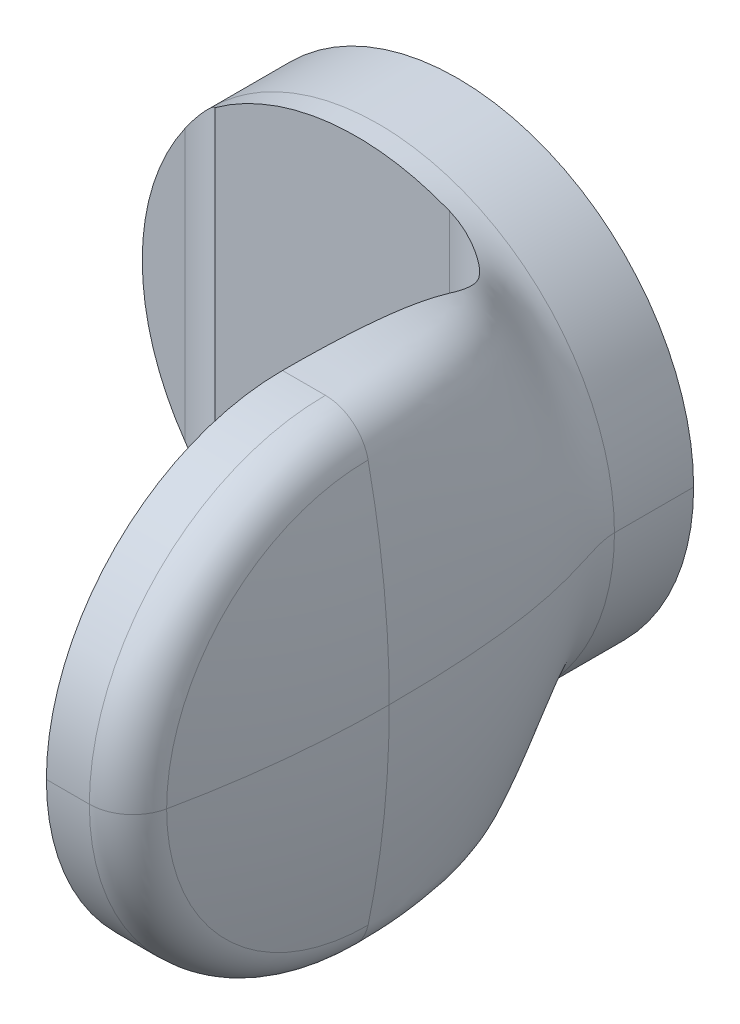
ISO-10303-21;
HEADER;
FILE_DESCRIPTION(('STEP AP214'),'2;1');
FILE_NAME('part.step','',(''),(''),'','','');
FILE_SCHEMA(('AUTOMOTIVE_DESIGN { 1 0 10303 214 1 1 1 1 }'));
ENDSEC;
DATA;
#1=APPLICATION_CONTEXT('core data for automotive mechanical design processes');
#2=APPLICATION_PROTOCOL_DEFINITION('international standard','automotive_design',2000,#1);
#3=PRODUCT_CONTEXT('',#1,'mechanical');
#4=PRODUCT('Part','Part','',(#3));
#5=PRODUCT_RELATED_PRODUCT_CATEGORY('part','',(#4));
#6=PRODUCT_DEFINITION_FORMATION('','',#4);
#7=PRODUCT_DEFINITION_CONTEXT('part definition',#1,'design');
#8=PRODUCT_DEFINITION('design','',#6,#7);
#9=PRODUCT_DEFINITION_SHAPE('','',#8);
#10=(LENGTH_UNIT() NAMED_UNIT(*) SI_UNIT(.MILLI.,.METRE.));
#11=(NAMED_UNIT(*) PLANE_ANGLE_UNIT() SI_UNIT($,.RADIAN.));
#12=(NAMED_UNIT(*) SI_UNIT($,.STERADIAN.) SOLID_ANGLE_UNIT());
#13=UNCERTAINTY_MEASURE_WITH_UNIT(LENGTH_MEASURE(1.E-05),#10,'distance_accuracy_value','');
#14=(GEOMETRIC_REPRESENTATION_CONTEXT(3) GLOBAL_UNCERTAINTY_ASSIGNED_CONTEXT((#13)) GLOBAL_UNIT_ASSIGNED_CONTEXT((#10,
#11,#12)) REPRESENTATION_CONTEXT('',''));
#15=CARTESIAN_POINT('',(0.,0.,0.));
#16=DIRECTION('',(0.,0.,1.));
#17=DIRECTION('',(1.,0.,0.));
#18=AXIS2_PLACEMENT_3D('',#15,#16,#17);
#19=CARTESIAN_POINT('',(-26.6414284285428,-32.55,20.));
#20=DIRECTION('',(0.,1.,0.));
#21=DIRECTION('',(0.,0.,1.));
#22=AXIS2_PLACEMENT_3D('',#19,#20,#21);
#23=CYLINDRICAL_SURFACE('',#22,10.);
#24=CARTESIAN_POINT('',(-19.5,-26.1874468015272,13.));
#25=CARTESIAN_POINT('',(-19.6419316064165,-26.0664711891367,12.8551882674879));
#26=CARTESIAN_POINT('',(-19.7869368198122,-25.9423437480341,12.7160748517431));
#27=CARTESIAN_POINT('',(-20.0818594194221,-25.6881748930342,12.4494053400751));
#28=CARTESIAN_POINT('',(-20.231770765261,-25.5581406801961,12.3218357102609));
#29=CARTESIAN_POINT('',(-20.5355594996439,-25.2923060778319,12.0781131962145));
#30=CARTESIAN_POINT('',(-20.6894354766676,-25.15650772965,11.9619563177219));
#31=CARTESIAN_POINT('',(-20.99900054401,-24.8804009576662,11.7417432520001));
#32=CARTESIAN_POINT('',(-21.1546664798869,-24.7401354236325,11.6376006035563));
#33=CARTESIAN_POINT('',(-21.468032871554,-24.4542260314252,11.4401938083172));
#34=CARTESIAN_POINT('',(-21.6257338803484,-24.3085806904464,11.3469326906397));
#35=CARTESIAN_POINT('',(-21.9422226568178,-24.0120969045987,11.1710562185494));
#36=CARTESIAN_POINT('',(-22.1010105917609,-23.861257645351,11.0884425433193));
#37=CARTESIAN_POINT('',(-22.4662367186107,-23.5087882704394,10.9104204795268));
#38=CARTESIAN_POINT('',(-22.6727490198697,-23.3054381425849,10.8185548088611));
#39=CARTESIAN_POINT('',(-23.0844755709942,-22.8907406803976,10.6513383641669));
#40=CARTESIAN_POINT('',(-23.2896895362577,-22.679391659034,10.5759910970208));
#41=CARTESIAN_POINT('',(-23.6973023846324,-22.2491217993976,10.4408035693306));
#42=CARTESIAN_POINT('',(-23.8997009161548,-22.0302000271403,10.3809652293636));
#43=CARTESIAN_POINT('',(-24.3008363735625,-21.5847835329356,10.2755596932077));
#44=CARTESIAN_POINT('',(-24.4995641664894,-21.358273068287,10.2300244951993));
#45=CARTESIAN_POINT('',(-24.8919120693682,-20.8987391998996,10.1521989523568));
#46=CARTESIAN_POINT('',(-25.0855330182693,-20.6657168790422,10.1199064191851));
#47=CARTESIAN_POINT('',(-25.4668625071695,-20.1937044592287,10.0673557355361));
#48=CARTESIAN_POINT('',(-25.6545730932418,-19.9547164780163,10.0470933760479));
#49=CARTESIAN_POINT('',(-25.9766169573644,-19.5325902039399,10.0211680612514));
#50=CARTESIAN_POINT('',(-26.112393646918,-19.3506910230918,10.0131036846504));
#51=CARTESIAN_POINT('',(-26.3797405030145,-18.9845703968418,10.0025334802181));
#52=CARTESIAN_POINT('',(-26.5113228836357,-18.8003583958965,10.0000097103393));
#53=CARTESIAN_POINT('',(-26.6409561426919,-18.614792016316,10.0000000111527));
#54=B_SPLINE_CURVE_WITH_KNOTS('',3,(#24,#25,#26,#27,#28,#29,#30,#31,#32,#33,#34,#35,#36,#37,#38,
#39,#40,#41,#42,#43,#44,#45,#46,#47,#48,#49,#50,#51,#52,#53),.UNSPECIFIED.,.F.,.F.,(4,2,2,2,2,2,
2,2,2,2,2,2,2,2,4),(0.,0.708187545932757,1.4155337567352,2.12263152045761,2.82427277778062,
3.52610888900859,4.22805555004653,5.13955011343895,6.05123800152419,6.96303873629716,
7.87686500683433,8.79054020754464,9.70389555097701,10.3851697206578,11.0642344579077),.UNSPECIFIED.);
#55=CARTESIAN_POINT('',(-19.5,-26.1874468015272,13.));
#56=VERTEX_POINT('',#55);
#57=CARTESIAN_POINT('',(-26.6411858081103,-18.6149524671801,10.));
#58=VERTEX_POINT('',#57);
#59=EDGE_CURVE('E94',#56,#58,#54,.T.);
#60=ORIENTED_EDGE('',*,*,#59,.F.);
#61=DIRECTION('',(0.,1.,0.));
#62=VECTOR('',#61,1.);
#63=CARTESIAN_POINT('',(-19.5,-32.55,13.));
#64=LINE('',#63,#62);
#65=CARTESIAN_POINT('',(-19.5,26.1874468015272,13.));
#66=VERTEX_POINT('',#65);
#67=EDGE_CURVE('E30',#56,#66,#64,.T.);
#68=ORIENTED_EDGE('',*,*,#67,.T.);
#69=CARTESIAN_POINT('',(-26.6409475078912,18.6148043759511,10.0000000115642));
#70=CARTESIAN_POINT('',(-26.4914228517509,18.8288573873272,10.0000126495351));
#71=CARTESIAN_POINT('',(-26.3392873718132,19.0411136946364,10.0033689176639));
#72=CARTESIAN_POINT('',(-26.0297397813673,19.4621686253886,10.0175191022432));
#73=CARTESIAN_POINT('',(-25.8723173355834,19.6709591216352,10.0283285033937));
#74=CARTESIAN_POINT('',(-25.5526008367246,20.0845374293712,10.0581568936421));
#75=CARTESIAN_POINT('',(-25.3903019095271,20.2893208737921,10.077184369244));
#76=CARTESIAN_POINT('',(-25.0613903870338,20.6944385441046,10.1242170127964));
#77=CARTESIAN_POINT('',(-24.8947767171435,20.8947716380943,10.1522244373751));
#78=CARTESIAN_POINT('',(-24.5636429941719,21.283710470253,10.2168378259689));
#79=CARTESIAN_POINT('',(-24.3992524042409,21.4724815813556,10.2531100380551));
#80=CARTESIAN_POINT('',(-24.0675596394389,21.8451069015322,10.335405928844));
#81=CARTESIAN_POINT('',(-23.9002590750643,22.0289636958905,10.3814243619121));
#82=CARTESIAN_POINT('',(-23.5634133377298,22.3914922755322,10.4838665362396));
#83=CARTESIAN_POINT('',(-23.3938692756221,22.5701664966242,10.5402852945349));
#84=CARTESIAN_POINT('',(-23.0532843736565,22.9221602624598,10.6641524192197));
#85=CARTESIAN_POINT('',(-22.882243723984,23.0954804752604,10.7315994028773));
#86=CARTESIAN_POINT('',(-22.5745546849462,23.4016906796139,10.8631226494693));
#87=CARTESIAN_POINT('',(-22.4380171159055,23.5356079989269,10.9250736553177));
#88=CARTESIAN_POINT('',(-22.1650281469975,23.7997815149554,11.0565781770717));
#89=CARTESIAN_POINT('',(-22.0285767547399,23.9300374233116,11.126132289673));
#90=CARTESIAN_POINT('',(-21.7563343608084,24.1867381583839,11.273043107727));
#91=CARTESIAN_POINT('',(-21.620543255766,24.3131835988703,11.3503985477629));
#92=CARTESIAN_POINT('',(-21.3502052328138,24.5621489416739,11.5130784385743));
#93=CARTESIAN_POINT('',(-21.2156580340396,24.6846697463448,11.5984010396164));
#94=CARTESIAN_POINT('',(-20.9446288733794,24.9291034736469,11.7796719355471));
#95=CARTESIAN_POINT('',(-20.808198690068,25.0509026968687,11.8758513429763));
#96=CARTESIAN_POINT('',(-20.5379139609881,25.2901761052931,12.0769016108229));
#97=CARTESIAN_POINT('',(-20.4040598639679,25.4076495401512,12.1817739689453));
#98=CARTESIAN_POINT('',(-20.1395364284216,25.6381721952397,12.4003390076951));
#99=CARTESIAN_POINT('',(-20.0088694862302,25.7512181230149,12.5140380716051));
#100=CARTESIAN_POINT('',(-19.7513417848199,25.9728045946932,12.7503568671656));
#101=CARTESIAN_POINT('',(-19.6244871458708,26.0813379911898,12.8729899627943));
#102=CARTESIAN_POINT('',(-19.5,26.1874468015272,13.));
#103=B_SPLINE_CURVE_WITH_KNOTS('',3,(#69,#70,#71,#72,#73,#74,#75,#76,#77,#78,#79,#80,#81,#82,
#83,#84,#85,#86,#87,#88,#89,#90,#91,#92,#93,#94,#95,#96,#97,#98,#99,#100,#101,#102),
.UNSPECIFIED.,.F.,.F.,(4,2,2,2,2,2,2,2,2,2,2,2,2,2,2,2,4),(0.,0.783310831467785,
1.56825400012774,2.35400969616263,3.13996300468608,3.8985200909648,4.65666993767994,
5.41445748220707,6.17215008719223,6.77508493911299,7.3780671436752,7.98095169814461,
8.58369662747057,9.20336857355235,9.82314750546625,10.4433788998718,11.0645579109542),.UNSPECIFIED.);
#104=CARTESIAN_POINT('',(-26.6411814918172,18.6149678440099,10.));
#105=VERTEX_POINT('',#104);
#106=EDGE_CURVE('E120',#105,#66,#103,.T.);
#107=ORIENTED_EDGE('',*,*,#106,.F.);
#108=DIRECTION('',(0.,1.,0.));
#109=VECTOR('',#108,1.);
#110=CARTESIAN_POINT('',(-26.6414284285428,-32.55,10.));
#111=LINE('',#110,#109);
#112=EDGE_CURVE('E11',#58,#105,#111,.T.);
#113=ORIENTED_EDGE('',*,*,#112,.F.);
#114=EDGE_LOOP('',(#60,#68,#107,#113));
#115=FACE_BOUND('',#114,.T.);
#116=ADVANCED_FACE('F16',(#115),#23,.F.);
#117=CARTESIAN_POINT('',(12.8,-32.55,23.));
#118=DIRECTION('',(0.,-1.,0.));
#119=DIRECTION('',(0.,0.,-1.));
#120=AXIS2_PLACEMENT_3D('',#117,#118,#119);
#121=CYLINDRICAL_SURFACE('',#120,10.);
#122=CARTESIAN_POINT('',(22.8,-30.2186695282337,23.));
#123=CARTESIAN_POINT('',(22.8000027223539,-30.1692381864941,22.8369596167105));
#124=CARTESIAN_POINT('',(22.796012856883,-30.1186828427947,22.6742659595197));
#125=CARTESIAN_POINT('',(22.7801706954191,-30.0154763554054,22.3499826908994));
#126=CARTESIAN_POINT('',(22.7683207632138,-29.9628258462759,22.1883927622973));
#127=CARTESIAN_POINT('',(22.7368823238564,-29.8555556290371,21.8666419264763));
#128=CARTESIAN_POINT('',(22.7172944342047,-29.8009360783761,21.706480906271));
#129=CARTESIAN_POINT('',(22.670397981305,-29.689650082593,21.3871073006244));
#130=CARTESIAN_POINT('',(22.6430516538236,-29.6329748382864,21.2279033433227));
#131=CARTESIAN_POINT('',(22.5808096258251,-29.5180955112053,20.9115178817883));
#132=CARTESIAN_POINT('',(22.5459134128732,-29.4598913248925,20.7543365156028));
#133=CARTESIAN_POINT('',(22.4880079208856,-29.3716995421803,20.5202897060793));
#134=CARTESIAN_POINT('',(22.4677784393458,-29.3421536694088,20.4425590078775));
#135=CARTESIAN_POINT('',(22.425476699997,-29.2828311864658,20.2876870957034));
#136=CARTESIAN_POINT('',(22.4034044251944,-29.2530545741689,20.2105458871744));
#137=CARTESIAN_POINT('',(22.3530139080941,-29.1875219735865,20.0421178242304));
#138=CARTESIAN_POINT('',(22.3243109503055,-29.1517176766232,19.9509645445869));
#139=CARTESIAN_POINT('',(22.2643486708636,-29.0797698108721,19.7696401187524));
#140=CARTESIAN_POINT('',(22.2330893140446,-29.0436262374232,19.6794689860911));
#141=CARTESIAN_POINT('',(22.1354731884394,-28.9350072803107,19.4103809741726));
#142=CARTESIAN_POINT('',(22.0652843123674,-28.862351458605,19.2329093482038));
#143=CARTESIAN_POINT('',(21.9146566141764,-28.7181208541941,18.8818023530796));
#144=CARTESIAN_POINT('',(21.834212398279,-28.6465466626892,18.7081690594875));
#145=CARTESIAN_POINT('',(21.6631280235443,-28.5065549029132,18.3651738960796));
#146=CARTESIAN_POINT('',(21.5725089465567,-28.4381312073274,18.1958040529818));
#147=CARTESIAN_POINT('',(21.3807458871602,-28.3065186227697,17.8611306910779));
#148=CARTESIAN_POINT('',(21.2796070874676,-28.2433271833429,17.6958252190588));
#149=CARTESIAN_POINT('',(21.0665590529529,-28.1247263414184,17.3695545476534));
#150=CARTESIAN_POINT('',(20.9546583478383,-28.0693108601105,17.2085860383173));
#151=CARTESIAN_POINT('',(20.7343019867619,-27.9751595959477,16.9109281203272));
#152=CARTESIAN_POINT('',(20.6271140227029,-27.9352107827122,16.7736867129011));
#153=CARTESIAN_POINT('',(20.4043393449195,-27.8652773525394,16.503489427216));
#154=CARTESIAN_POINT('',(20.2887535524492,-27.83529164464,16.3705330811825));
#155=CARTESIAN_POINT('',(20.1096415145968,-27.7990419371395,16.1752719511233));
#156=CARTESIAN_POINT('',(20.0491034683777,-27.7884255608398,16.1109997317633));
#157=CARTESIAN_POINT('',(19.9261199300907,-27.7702061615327,15.9838590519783));
#158=CARTESIAN_POINT('',(19.8636744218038,-27.7626031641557,15.9209906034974));
#159=CARTESIAN_POINT('',(19.7369805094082,-27.7505227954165,15.7967945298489));
#160=CARTESIAN_POINT('',(19.6727322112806,-27.7460452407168,15.735466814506));
#161=CARTESIAN_POINT('',(19.5425511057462,-27.7402809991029,15.6144799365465));
#162=CARTESIAN_POINT('',(19.4766183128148,-27.738994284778,15.554820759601));
#163=CARTESIAN_POINT('',(19.2760211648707,-27.7402105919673,15.3781276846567));
#164=CARTESIAN_POINT('',(19.1389673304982,-27.747831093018,15.2637796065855));
#165=CARTESIAN_POINT('',(18.8598132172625,-27.7761425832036,15.0432206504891));
#166=CARTESIAN_POINT('',(18.7177126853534,-27.7968342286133,14.9370101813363));
#167=CARTESIAN_POINT('',(18.4290495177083,-27.8500938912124,14.7328862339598));
#168=CARTESIAN_POINT('',(18.2824722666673,-27.8827057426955,14.6350050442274));
#169=CARTESIAN_POINT('',(17.9862369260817,-27.9580149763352,14.4481795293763));
#170=CARTESIAN_POINT('',(17.8365780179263,-28.0007150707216,14.3592376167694));
#171=CARTESIAN_POINT('',(17.5354322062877,-28.0940994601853,14.1906100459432));
#172=CARTESIAN_POINT('',(17.3839548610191,-28.1447515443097,14.1108892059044));
#173=CARTESIAN_POINT('',(17.0789029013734,-28.2523929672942,13.9600909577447));
#174=CARTESIAN_POINT('',(16.925327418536,-28.3093850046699,13.8890172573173));
#175=CARTESIAN_POINT('',(16.6163094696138,-28.4281162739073,13.7553186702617));
#176=CARTESIAN_POINT('',(16.4608665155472,-28.4898567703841,13.6926960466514));
#177=CARTESIAN_POINT('',(16.1480491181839,-28.6168011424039,13.5756435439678));
#178=CARTESIAN_POINT('',(15.9906722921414,-28.6820097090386,13.5212251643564));
#179=CARTESIAN_POINT('',(15.6743232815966,-28.8146437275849,13.4205527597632));
#180=CARTESIAN_POINT('',(15.5153516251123,-28.8820684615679,13.3742961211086));
#181=CARTESIAN_POINT('',(15.1958519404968,-29.0181889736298,13.2898408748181));
#182=CARTESIAN_POINT('',(15.035324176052,-29.0868845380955,13.2516409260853));
#183=CARTESIAN_POINT('',(14.7604080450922,-29.2044006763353,13.1933545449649));
#184=CARTESIAN_POINT('',(14.6463912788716,-29.2531007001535,13.1712501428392));
#185=CARTESIAN_POINT('',(14.4176683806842,-29.3504995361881,13.1310268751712));
#186=CARTESIAN_POINT('',(14.3029623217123,-29.3991983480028,13.112907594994));
#187=CARTESIAN_POINT('',(14.0729091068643,-29.4963820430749,13.0806657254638));
#188=CARTESIAN_POINT('',(13.9575619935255,-29.5448669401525,13.0665428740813));
#189=CARTESIAN_POINT('',(13.7269276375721,-29.6411615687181,13.042381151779));
#190=CARTESIAN_POINT('',(13.6116436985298,-29.6889735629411,13.0323197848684));
#191=CARTESIAN_POINT('',(13.3805541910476,-29.7840304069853,13.0161944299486));
#192=CARTESIAN_POINT('',(13.2647485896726,-29.8312752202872,13.0101306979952));
#193=CARTESIAN_POINT('',(13.0326866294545,-29.9250540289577,13.0020333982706));
#194=CARTESIAN_POINT('',(12.9164301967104,-29.9715879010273,13.0000005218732));
#195=CARTESIAN_POINT('',(12.8,-30.017687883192,13.));
#196=B_SPLINE_CURVE_WITH_KNOTS('',3,(#122,#123,#124,#125,#126,#127,#128,#129,#130,#131,#132,
#133,#134,#135,#136,#137,#138,#139,#140,#141,#142,#143,#144,#145,#146,#147,#148,#149,#150,#151,
#152,#153,#154,#155,#156,#157,#158,#159,#160,#161,#162,#163,#164,#165,#166,#167,#168,#169,#170,
#171,#172,#173,#174,#175,#176,#177,#178,#179,#180,#181,#182,#183,#184,#185,#186,#187,#188,#189,
#190,#191,#192,#193,#194,#195),.UNSPECIFIED.,.F.,.F.,(4,2,2,2,2,2,2,2,2,2,2,2,2,2,2,2,2,2,2,2,2,
2,2,2,2,2,2,2,2,2,2,2,2,2,2,2,4),(0.,0.511048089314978,1.02194255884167,1.53279626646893,
2.04618052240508,2.55959963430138,2.81632679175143,3.07305631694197,3.37917403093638,
3.68529595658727,4.2976061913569,4.91023980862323,5.52162671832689,6.13271383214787,
6.74332053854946,7.27886098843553,7.814342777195,8.08106284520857,8.34778518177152,
8.61449187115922,8.88119626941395,9.41632252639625,9.95147565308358,10.4886168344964,
11.0259025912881,11.5610656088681,12.0964572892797,12.631992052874,13.1682706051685,
13.7043771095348,14.2403943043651,14.6181453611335,14.9958570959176,15.3735440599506,
15.7491093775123,16.1246987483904,16.5003525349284),.UNSPECIFIED.);
#197=CARTESIAN_POINT('',(22.8,-30.2186695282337,23.));
#198=VERTEX_POINT('',#197);
#199=CARTESIAN_POINT('',(12.8,-30.017687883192,13.));
#200=VERTEX_POINT('',#199);
#201=EDGE_CURVE('E88',#198,#200,#196,.T.);
#202=ORIENTED_EDGE('',*,*,#201,.F.);
#203=DIRECTION('',(0.,-1.,0.));
#204=VECTOR('',#203,1.);
#205=CARTESIAN_POINT('',(22.8,-23.9086112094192,23.));
#206=LINE('',#205,#204);
#207=CARTESIAN_POINT('',(22.8,30.2186695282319,22.9999999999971));
#208=VERTEX_POINT('',#207);
#209=EDGE_CURVE('E82',#208,#198,#206,.T.);
#210=ORIENTED_EDGE('',*,*,#209,.F.);
#211=CARTESIAN_POINT('',(12.8,30.017687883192,13.));
#212=CARTESIAN_POINT('',(13.0010701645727,29.9381045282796,13.0000066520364));
#213=CARTESIAN_POINT('',(13.201597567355,29.8571895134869,13.0060643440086));
#214=CARTESIAN_POINT('',(13.6013352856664,29.6934909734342,13.0301446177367));
#215=CARTESIAN_POINT('',(13.800544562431,29.6107061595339,13.0481757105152));
#216=CARTESIAN_POINT('',(14.1972050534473,29.4441458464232,13.0960745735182));
#217=CARTESIAN_POINT('',(14.3946555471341,29.3603699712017,13.1259469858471));
#218=CARTESIAN_POINT('',(14.7905670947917,29.1916081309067,13.1980221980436));
#219=CARTESIAN_POINT('',(14.9889948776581,29.1066239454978,13.2404122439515));
#220=CARTESIAN_POINT('',(15.3834363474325,28.9381611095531,13.3373350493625));
#221=CARTESIAN_POINT('',(15.5794507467,28.8546820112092,13.3918641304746));
#222=CARTESIAN_POINT('',(15.9689352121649,28.6909303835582,13.5131966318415));
#223=CARTESIAN_POINT('',(16.1624062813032,28.6106565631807,13.579995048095));
#224=CARTESIAN_POINT('',(16.473662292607,28.48493718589,13.6983636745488));
#225=CARTESIAN_POINT('',(16.592263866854,28.4378509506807,13.7460714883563));
#226=CARTESIAN_POINT('',(16.8283960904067,28.3463357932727,13.8463953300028));
#227=CARTESIAN_POINT('',(16.9459269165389,28.3019064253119,13.8990105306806));
#228=CARTESIAN_POINT('',(17.1798639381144,28.2163727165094,14.0092540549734));
#229=CARTESIAN_POINT('',(17.2962700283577,28.1752686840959,14.0668828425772));
#230=CARTESIAN_POINT('',(17.5272115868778,28.0973507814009,14.1869235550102));
#231=CARTESIAN_POINT('',(17.6417536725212,28.0605154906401,14.2493087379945));
#232=CARTESIAN_POINT('',(17.8693967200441,27.9916892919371,14.379188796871));
#233=CARTESIAN_POINT('',(17.9824977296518,27.9596982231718,14.4466835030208));
#234=CARTESIAN_POINT('',(18.206964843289,27.9013897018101,14.5867823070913));
#235=CARTESIAN_POINT('',(18.3183312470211,27.8750712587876,14.6593855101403));
#236=CARTESIAN_POINT('',(18.5676034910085,27.8229086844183,14.8291375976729));
#237=CARTESIAN_POINT('',(18.7049059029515,27.7989558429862,14.9277707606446));
#238=CARTESIAN_POINT('',(18.9752826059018,27.7626356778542,15.1326857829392));
#239=CARTESIAN_POINT('',(19.1083576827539,27.7502661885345,15.2389662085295));
#240=CARTESIAN_POINT('',(19.303936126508,27.7409300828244,15.4035479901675));
#241=CARTESIAN_POINT('',(19.3684416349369,27.739353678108,15.4592548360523));
#242=CARTESIAN_POINT('',(19.4960089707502,27.7392945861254,15.5723000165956));
#243=CARTESIAN_POINT('',(19.559070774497,27.7408119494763,15.6296383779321));
#244=CARTESIAN_POINT('',(19.7459182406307,27.7497598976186,15.8039446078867));
#245=CARTESIAN_POINT('',(19.8673817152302,27.7615856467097,15.923216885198));
#246=CARTESIAN_POINT('',(20.1025564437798,27.7962650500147,16.1661800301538));
#247=CARTESIAN_POINT('',(20.2163105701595,27.8190508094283,16.2898394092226));
#248=CARTESIAN_POINT('',(20.4364037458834,27.874431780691,16.5414176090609));
#249=CARTESIAN_POINT('',(20.5427430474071,27.9070266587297,16.6693362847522));
#250=CARTESIAN_POINT('',(20.8509384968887,28.0175090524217,17.0592652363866));
#251=CARTESIAN_POINT('',(21.0413814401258,28.1079936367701,17.3268341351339));
#252=CARTESIAN_POINT('',(21.3205910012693,28.2683709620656,17.7619974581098));
#253=CARTESIAN_POINT('',(21.4192068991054,28.3316695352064,17.9259892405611));
#254=CARTESIAN_POINT('',(21.6062209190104,28.4631083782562,18.2579797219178));
#255=CARTESIAN_POINT('',(21.6946135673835,28.5312512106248,18.4259805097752));
#256=CARTESIAN_POINT('',(21.8613436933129,28.6702698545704,18.7658642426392));
#257=CARTESIAN_POINT('',(21.9396775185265,28.741146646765,18.937748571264));
#258=CARTESIAN_POINT('',(22.0496962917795,28.8481506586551,19.1984204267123));
#259=CARTESIAN_POINT('',(22.0851228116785,28.8839341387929,19.2857869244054));
#260=CARTESIAN_POINT('',(22.1534881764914,28.9555351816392,19.461477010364));
#261=CARTESIAN_POINT('',(22.1864270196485,28.9913527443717,19.5498005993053));
#262=CARTESIAN_POINT('',(22.2497995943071,29.0628326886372,19.7273601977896));
#263=CARTESIAN_POINT('',(22.2802342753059,29.0984951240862,19.8165958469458));
#264=CARTESIAN_POINT('',(22.3386071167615,29.1694563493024,19.9960240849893));
#265=CARTESIAN_POINT('',(22.3665452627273,29.2047551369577,20.0862166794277));
#266=CARTESIAN_POINT('',(22.419875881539,29.2750531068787,20.2674355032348));
#267=CARTESIAN_POINT('',(22.4452690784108,29.3100523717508,20.3584614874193));
#268=CARTESIAN_POINT('',(22.4934948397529,29.3796918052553,20.5413218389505));
#269=CARTESIAN_POINT('',(22.5163274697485,29.4143319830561,20.6331561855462));
#270=CARTESIAN_POINT('',(22.5666458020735,29.4947301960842,20.8485737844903));
#271=CARTESIAN_POINT('',(22.5931183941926,29.5403144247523,20.9724602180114));
#272=CARTESIAN_POINT('',(22.6413879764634,29.6305262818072,21.2214709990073));
#273=CARTESIAN_POINT('',(22.6631854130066,29.6751540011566,21.3465952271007));
#274=CARTESIAN_POINT('',(22.7020411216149,29.7633228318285,21.5979473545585));
#275=CARTESIAN_POINT('',(22.7190997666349,29.8068640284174,21.7241751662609));
#276=CARTESIAN_POINT('',(22.7483886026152,29.8926825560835,21.9773675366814));
#277=CARTESIAN_POINT('',(22.7606272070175,29.9349619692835,22.1043304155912));
#278=CARTESIAN_POINT('',(22.7802559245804,30.0182556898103,22.3590564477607));
#279=CARTESIAN_POINT('',(22.7876456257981,30.0592698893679,22.4868196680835));
#280=CARTESIAN_POINT('',(22.7975188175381,30.1399780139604,22.7429841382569));
#281=CARTESIAN_POINT('',(22.8000011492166,30.1796716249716,22.8713855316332));
#282=CARTESIAN_POINT('',(22.8,30.2186695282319,22.9999999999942));
#283=B_SPLINE_CURVE_WITH_KNOTS('',3,(#211,#212,#213,#214,#215,#216,#217,#218,#219,#220,#221,
#222,#223,#224,#225,#226,#227,#228,#229,#230,#231,#232,#233,#234,#235,#236,#237,#238,#239,#240,
#241,#242,#243,#244,#245,#246,#247,#248,#249,#250,#251,#252,#253,#254,#255,#256,#257,#258,#259,
#260,#261,#262,#263,#264,#265,#266,#267,#268,#269,#270,#271,#272,#273,#274,#275,#276,#277,#278,
#279,#280,#281,#282),.UNSPECIFIED.,.F.,.F.,(4,2,2,2,2,2,2,2,2,2,2,2,2,2,2,2,2,2,2,2,2,2,2,2,2,2,
2,2,2,2,2,2,2,2,2,4),(0.,0.648631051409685,1.29772366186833,1.94707098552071,2.60667133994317,
3.2660720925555,3.9252045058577,4.33380312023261,4.74233298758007,5.15090070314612,
5.55732025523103,5.9637263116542,6.37006135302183,6.88172284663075,7.39328866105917,
7.64894931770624,7.90461415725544,8.41588222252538,8.92402310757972,9.43214670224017,
10.4509443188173,11.0553531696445,11.6600841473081,12.265034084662,12.5675203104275,
12.8700067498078,13.17237796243,13.4747509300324,13.7770376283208,14.0793165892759,
14.4831281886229,14.886901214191,15.2906424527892,15.6936757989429,16.0967433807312,
16.4999061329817),.UNSPECIFIED.);
#284=CARTESIAN_POINT('',(12.8,30.017687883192,13.));
#285=VERTEX_POINT('',#284);
#286=EDGE_CURVE('E85',#285,#208,#283,.T.);
#287=ORIENTED_EDGE('',*,*,#286,.F.);
#288=DIRECTION('',(0.,1.,0.));
#289=VECTOR('',#288,1.);
#290=CARTESIAN_POINT('',(12.8,23.9086112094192,13.));
#291=LINE('',#290,#289);
#292=EDGE_CURVE('E93',#200,#285,#291,.T.);
#293=ORIENTED_EDGE('',*,*,#292,.F.);
#294=EDGE_LOOP('',(#202,#210,#287,#293));
#295=FACE_BOUND('',#294,.T.);
#296=ADVANCED_FACE('F84',(#295),#121,.F.);
#297=CARTESIAN_POINT('',(0.,-32.55,10.));
#298=DIRECTION('',(0.,0.,-1.));
#299=DIRECTION('',(0.,-1.,0.));
#300=AXIS2_PLACEMENT_3D('',#297,#298,#299);
#301=PLANE('',#300);
#302=CARTESIAN_POINT('',(0.,0.,10.));
#303=DIRECTION('',(0.,0.,-1.));
#304=DIRECTION('',(-1.,0.,0.));
#305=AXIS2_PLACEMENT_3D('',#302,#303,#304);
#306=CIRCLE('',#305,32.5);
#307=CARTESIAN_POINT('',(-32.5,0.,10.));
#308=VERTEX_POINT('',#307);
#309=EDGE_CURVE('E318',#58,#308,#306,.T.);
#310=ORIENTED_EDGE('',*,*,#309,.F.);
#311=ORIENTED_EDGE('',*,*,#112,.T.);
#312=CARTESIAN_POINT('',(0.,0.,10.));
#313=DIRECTION('',(0.,0.,-1.));
#314=DIRECTION('',(-1.,0.,0.));
#315=AXIS2_PLACEMENT_3D('',#312,#313,#314);
#316=CIRCLE('',#315,32.5);
#317=EDGE_CURVE('E138',#105,#308,#316,.F.);
#318=ORIENTED_EDGE('',*,*,#317,.T.);
#319=EDGE_LOOP('',(#310,#311,#318));
#320=FACE_BOUND('',#319,.T.);
#321=ADVANCED_FACE('F230',(#320),#301,.F.);
#322=CARTESIAN_POINT('',(0.,-32.55,13.));
#323=DIRECTION('',(0.,0.,-1.));
#324=DIRECTION('',(-1.,0.,0.));
#325=AXIS2_PLACEMENT_3D('',#322,#323,#324);
#326=PLANE('',#325);
#327=CARTESIAN_POINT('',(-19.5,-26.1874468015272,13.));
#328=CARTESIAN_POINT('',(-19.3762882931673,-26.2776398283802,13.));
#329=CARTESIAN_POINT('',(-19.2519041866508,-26.3669080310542,13.));
#330=CARTESIAN_POINT('',(-19.0018191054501,-26.5435742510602,13.));
#331=CARTESIAN_POINT('',(-18.8761181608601,-26.630972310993,13.));
#332=CARTESIAN_POINT('',(-18.4970890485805,-26.890325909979,13.));
#333=CARTESIAN_POINT('',(-18.241819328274,-27.0594520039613,13.));
#334=CARTESIAN_POINT('',(-17.7267424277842,-27.3905841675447,13.));
#335=CARTESIAN_POINT('',(-17.4669356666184,-27.5525908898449,13.));
#336=CARTESIAN_POINT('',(-16.9429557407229,-27.869372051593,13.));
#337=CARTESIAN_POINT('',(-16.6787824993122,-28.0241463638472,13.));
#338=CARTESIAN_POINT('',(-15.8800382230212,-28.4774897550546,13.));
#339=CARTESIAN_POINT('',(-15.3391784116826,-28.7651205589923,13.));
#340=CARTESIAN_POINT('',(-14.5173559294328,-29.1732619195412,13.));
#341=CARTESIAN_POINT('',(-14.2420294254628,-29.3052661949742,13.));
#342=CARTESIAN_POINT('',(-13.6877908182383,-29.5615215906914,13.));
#343=CARTESIAN_POINT('',(-13.4088787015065,-29.6857726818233,13.));
#344=CARTESIAN_POINT('',(-12.5671660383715,-30.0469369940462,13.));
#345=CARTESIAN_POINT('',(-11.9993354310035,-30.2722879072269,13.));
#346=CARTESIAN_POINT('',(-11.1390762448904,-30.5867112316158,13.));
#347=CARTESIAN_POINT('',(-10.8508921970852,-30.6875888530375,13.));
#348=CARTESIAN_POINT('',(-10.2718546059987,-30.8813661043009,13.));
#349=CARTESIAN_POINT('',(-9.98100110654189,-30.9742658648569,13.));
#350=CARTESIAN_POINT('',(-9.10449533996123,-31.240757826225,13.));
#351=CARTESIAN_POINT('',(-8.51506501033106,-31.4020814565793,13.));
#352=CARTESIAN_POINT('',(-7.328268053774,-31.6921089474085,13.));
#353=CARTESIAN_POINT('',(-6.7309012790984,-31.8208121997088,13.));
#354=CARTESIAN_POINT('',(-5.52999738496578,-32.0453059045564,13.));
#355=CARTESIAN_POINT('',(-4.9264602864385,-32.1410964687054,13.));
#356=CARTESIAN_POINT('',(-3.71456064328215,-32.2991058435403,13.));
#357=CARTESIAN_POINT('',(-3.10619481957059,-32.3612994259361,13.));
#358=CARTESIAN_POINT('',(-1.88694455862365,-32.4523734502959,13.));
#359=CARTESIAN_POINT('',(-1.27606011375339,-32.4812537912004,13.));
#360=CARTESIAN_POINT('',(-0.359305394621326,-32.4994545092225,13.));
#361=CARTESIAN_POINT('',(-0.0536374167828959,-32.5013343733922,13.));
#362=CARTESIAN_POINT('',(0.557635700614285,-32.4967896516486,13.));
#363=CARTESIAN_POINT('',(0.863240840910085,-32.4903651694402,13.));
#364=CARTESIAN_POINT('',(1.66591294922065,-32.4625380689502,13.));
#365=CARTESIAN_POINT('',(2.16275773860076,-32.4342652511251,13.));
#366=CARTESIAN_POINT('',(3.15471876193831,-32.3556869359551,13.));
#367=CARTESIAN_POINT('',(3.64983488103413,-32.3053800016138,13.));
#368=CARTESIAN_POINT('',(4.63745317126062,-32.1831477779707,13.));
#369=CARTESIAN_POINT('',(5.12995500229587,-32.1112197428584,13.));
#370=CARTESIAN_POINT('',(6.11144988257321,-31.9461453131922,13.));
#371=CARTESIAN_POINT('',(6.60044249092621,-31.8529962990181,13.));
#372=CARTESIAN_POINT('',(7.57443773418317,-31.6455911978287,13.));
#373=CARTESIAN_POINT('',(8.05943591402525,-31.5313141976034,13.));
#374=CARTESIAN_POINT('',(9.02410511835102,-31.2822519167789,13.));
#375=CARTESIAN_POINT('',(9.50377641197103,-31.1474676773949,13.));
#376=CARTESIAN_POINT('',(10.4569796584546,-30.858052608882,13.));
#377=CARTESIAN_POINT('',(10.9305128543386,-30.7034258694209,13.));
#378=CARTESIAN_POINT('',(11.8706081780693,-30.3748930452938,13.));
#379=CARTESIAN_POINT('',(12.3371733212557,-30.2009955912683,13.));
#380=CARTESIAN_POINT('',(12.8,-30.017687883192,13.));
#381=B_SPLINE_CURVE_WITH_KNOTS('',3,(#327,#328,#329,#330,#331,#332,#333,#334,#335,#336,#337,
#338,#339,#340,#341,#342,#343,#344,#345,#346,#347,#348,#349,#350,#351,#352,#353,#354,#355,#356,
#357,#358,#359,#360,#361,#362,#363,#364,#365,#366,#367,#368,#369,#370,#371,#372,#373,#374,#375,
#376,#377,#378,#379,#380),.UNSPECIFIED.,.F.,.F.,(4,2,2,2,2,2,2,2,2,2,2,2,2,2,2,2,2,2,2,2,2,2,2,
2,2,2,4),(0.,0.459290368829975,0.918570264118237,1.83707337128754,2.75549209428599,
3.67392696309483,5.51056796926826,6.42647730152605,7.34239007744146,9.17403588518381,
10.0899346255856,11.0058183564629,12.8381192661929,14.670454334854,16.5027831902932,
18.3364860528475,20.1701944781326,21.0871190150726,22.0040321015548,23.4964539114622,
24.9889730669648,26.4816818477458,27.9745749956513,29.4689538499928,30.963256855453,
32.4572523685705,33.9505814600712),.UNSPECIFIED.);
#382=EDGE_CURVE('E222',#56,#200,#381,.T.);
#383=ORIENTED_EDGE('',*,*,#382,.T.);
#384=ORIENTED_EDGE('',*,*,#292,.T.);
#385=CARTESIAN_POINT('',(12.8,30.017687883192,13.));
#386=CARTESIAN_POINT('',(12.3331089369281,30.2026057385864,13.));
#387=CARTESIAN_POINT('',(11.8624131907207,30.3779470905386,13.));
#388=CARTESIAN_POINT('',(10.913963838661,30.7090145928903,13.));
#389=CARTESIAN_POINT('',(10.4362074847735,30.8647328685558,13.));
#390=CARTESIAN_POINT('',(9.47447986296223,31.1559684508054,13.));
#391=CARTESIAN_POINT('',(8.99050753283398,31.2914822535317,13.));
#392=CARTESIAN_POINT('',(8.01717194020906,31.5416254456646,13.));
#393=CARTESIAN_POINT('',(7.52780849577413,31.6562541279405,13.));
#394=CARTESIAN_POINT('',(6.54459914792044,31.8640745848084,13.));
#395=CARTESIAN_POINT('',(6.05075369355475,31.9572684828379,13.));
#396=CARTESIAN_POINT('',(5.05951988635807,32.1220174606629,13.));
#397=CARTESIAN_POINT('',(4.56213191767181,32.193574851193,13.));
#398=CARTESIAN_POINT('',(3.56471487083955,32.3146207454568,13.));
#399=CARTESIAN_POINT('',(3.06468603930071,32.3641112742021,13.));
#400=CARTESIAN_POINT('',(2.06292620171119,32.4406100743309,13.));
#401=CARTESIAN_POINT('',(1.56119521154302,32.4676185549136,13.));
#402=CARTESIAN_POINT('',(0.387676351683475,32.504493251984,13.));
#403=CARTESIAN_POINT('',(-0.284406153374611,32.5055081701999,13.));
#404=CARTESIAN_POINT('',(-1.62750681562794,32.4671644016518,13.));
#405=CARTESIAN_POINT('',(-2.29852486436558,32.4278018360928,13.));
#406=CARTESIAN_POINT('',(-3.30230469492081,32.3385416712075,13.));
#407=CARTESIAN_POINT('',(-3.63646757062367,32.3037481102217,13.));
#408=CARTESIAN_POINT('',(-4.30357555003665,32.2240156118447,13.));
#409=CARTESIAN_POINT('',(-4.63652065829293,32.1790767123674,13.));
#410=CARTESIAN_POINT('',(-5.63234945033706,32.0291921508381,13.));
#411=CARTESIAN_POINT('',(-6.2930414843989,31.90910626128,13.));
#412=CARTESIAN_POINT('',(-7.27762157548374,31.6994417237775,13.));
#413=CARTESIAN_POINT('',(-7.60474907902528,31.6246280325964,13.));
#414=CARTESIAN_POINT('',(-8.25661174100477,31.4651545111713,13.));
#415=CARTESIAN_POINT('',(-8.58134690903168,31.3804947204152,13.));
#416=CARTESIAN_POINT('',(-9.22802638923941,31.2012987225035,13.));
#417=CARTESIAN_POINT('',(-9.54997111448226,31.1067640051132,13.));
#418=CARTESIAN_POINT('',(-10.1908004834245,30.9078713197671,13.));
#419=CARTESIAN_POINT('',(-10.5096851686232,30.8035134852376,13.));
#420=CARTESIAN_POINT('',(-11.3420254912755,30.5171397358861,13.));
#421=CARTESIAN_POINT('',(-11.8528019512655,30.3272803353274,13.));
#422=CARTESIAN_POINT('',(-12.8644153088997,29.9228727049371,13.));
#423=CARTESIAN_POINT('',(-13.3652535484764,29.7083278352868,13.));
#424=CARTESIAN_POINT('',(-14.1079957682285,29.3680614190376,13.));
#425=CARTESIAN_POINT('',(-14.3541574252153,29.2515643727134,13.));
#426=CARTESIAN_POINT('',(-14.8435088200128,29.0124870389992,13.));
#427=CARTESIAN_POINT('',(-15.0866985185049,28.8899066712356,13.));
#428=CARTESIAN_POINT('',(-15.8121841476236,28.5129653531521,13.));
#429=CARTESIAN_POINT('',(-16.2898769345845,28.2496425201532,13.));
#430=CARTESIAN_POINT('',(-16.9962761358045,27.8373921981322,13.));
#431=CARTESIAN_POINT('',(-17.2300714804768,27.6970854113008,13.));
#432=CARTESIAN_POINT('',(-17.6941451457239,27.4107558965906,13.));
#433=CARTESIAN_POINT('',(-17.9244235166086,27.2647332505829,13.));
#434=CARTESIAN_POINT('',(-18.26711264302,27.0414705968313,13.));
#435=CARTESIAN_POINT('',(-18.380901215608,26.9663355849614,13.));
#436=CARTESIAN_POINT('',(-18.6074812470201,26.8145758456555,13.));
#437=CARTESIAN_POINT('',(-18.7202727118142,26.7379511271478,13.));
#438=CARTESIAN_POINT('',(-18.9448337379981,26.5832105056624,13.));
#439=CARTESIAN_POINT('',(-19.0566032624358,26.5050945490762,13.));
#440=CARTESIAN_POINT('',(-19.2790941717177,26.3473802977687,13.));
#441=CARTESIAN_POINT('',(-19.3898155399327,26.2677819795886,13.));
#442=CARTESIAN_POINT('',(-19.5,26.1874468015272,13.));
#443=B_SPLINE_CURVE_WITH_KNOTS('',3,(#385,#386,#387,#388,#389,#390,#391,#392,#393,#394,#395,
#396,#397,#398,#399,#400,#401,#402,#403,#404,#405,#406,#407,#408,#409,#410,#411,#412,#413,#414,
#415,#416,#417,#418,#419,#420,#421,#422,#423,#424,#425,#426,#427,#428,#429,#430,#431,#432,#433,
#434,#435,#436,#437,#438,#439,#440,#441,#442),.UNSPECIFIED.,.F.,.F.,(4,2,2,2,2,2,2,2,2,2,2,2,2,
2,2,2,2,2,2,2,2,2,2,2,2,2,2,2,4),(0.,1.50644194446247,3.01348651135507,4.52079212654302,
6.02814876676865,7.53535601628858,9.04240224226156,10.5493101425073,12.0562040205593,
14.0712207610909,16.0864310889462,17.0942026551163,18.101970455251,20.1150557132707,
21.1216633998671,22.1282670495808,23.1347190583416,24.1411573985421,25.7752439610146,
27.409108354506,28.2260412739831,29.042984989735,30.6785858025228,31.4965216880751,
32.3144458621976,32.723506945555,33.1325655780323,33.541638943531,33.9507187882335),.UNSPECIFIED.);
#444=EDGE_CURVE('E101',#285,#66,#443,.T.);
#445=ORIENTED_EDGE('',*,*,#444,.T.);
#446=ORIENTED_EDGE('',*,*,#67,.F.);
#447=EDGE_LOOP('',(#383,#384,#445,#446));
#448=FACE_BOUND('',#447,.T.);
#449=ADVANCED_FACE('F144',(#448),#326,.F.);
#450=CARTESIAN_POINT('',(22.8,-32.55,0.));
#451=DIRECTION('',(1.,0.,0.));
#452=DIRECTION('',(0.,1.,0.));
#453=AXIS2_PLACEMENT_3D('',#450,#451,#452);
#454=PLANE('',#453);
#455=CARTESIAN_POINT('',(22.8,32.5,46.));
#456=CARTESIAN_POINT('',(22.8,32.4999968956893,45.5944862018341));
#457=CARTESIAN_POINT('',(22.8,32.49882742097,45.1889714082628));
#458=CARTESIAN_POINT('',(22.8,32.4940036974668,44.3779406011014));
#459=CARTESIAN_POINT('',(22.8,32.4903493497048,43.9724245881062));
#460=CARTESIAN_POINT('',(22.8,32.4804037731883,43.1614203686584));
#461=CARTESIAN_POINT('',(22.8,32.4741125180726,42.7559321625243));
#462=CARTESIAN_POINT('',(22.8,32.4587162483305,41.9450136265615));
#463=CARTESIAN_POINT('',(22.8,32.4496112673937,41.5395832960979));
#464=CARTESIAN_POINT('',(22.8,32.4283881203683,40.7288107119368));
#465=CARTESIAN_POINT('',(22.8,32.4162700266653,40.3234684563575));
#466=CARTESIAN_POINT('',(22.8,32.3888544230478,39.5147264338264));
#467=CARTESIAN_POINT('',(22.8,32.3735715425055,39.1113261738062));
#468=CARTESIAN_POINT('',(22.8,32.339535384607,38.3046707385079));
#469=CARTESIAN_POINT('',(22.8,32.3207821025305,37.9014155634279));
#470=CARTESIAN_POINT('',(22.8,32.2795072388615,37.095082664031));
#471=CARTESIAN_POINT('',(22.8,32.2569855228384,36.692004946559));
#472=CARTESIAN_POINT('',(22.8,32.2078280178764,35.8860620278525));
#473=CARTESIAN_POINT('',(22.8,32.1811918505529,35.4831968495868));
#474=CARTESIAN_POINT('',(22.8,32.1234019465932,34.677716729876));
#475=CARTESIAN_POINT('',(22.8,32.092247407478,34.2751018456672));
#476=CARTESIAN_POINT('',(22.8,32.0279838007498,33.5065019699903));
#477=CARTESIAN_POINT('',(22.8,31.9953029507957,33.1404812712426));
#478=CARTESIAN_POINT('',(22.8,31.925403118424,32.4088672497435));
#479=CARTESIAN_POINT('',(22.8,31.8881840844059,32.0432739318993));
#480=CARTESIAN_POINT('',(22.8,31.8087369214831,31.3126890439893));
#481=CARTESIAN_POINT('',(22.8,31.7665095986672,30.9476973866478));
#482=CARTESIAN_POINT('',(22.8,31.6764961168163,30.2184988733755));
#483=CARTESIAN_POINT('',(22.8,31.6287114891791,29.8542918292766));
#484=CARTESIAN_POINT('',(22.8,31.526937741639,29.126856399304));
#485=CARTESIAN_POINT('',(22.8,31.4729505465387,28.7636277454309));
#486=CARTESIAN_POINT('',(22.8,31.3577586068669,28.0367813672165));
#487=CARTESIAN_POINT('',(22.8,31.2965251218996,27.6731681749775));
#488=CARTESIAN_POINT('',(22.8,31.1661063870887,26.9473546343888));
#489=CARTESIAN_POINT('',(22.8,31.0969209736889,26.5851543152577));
#490=CARTESIAN_POINT('',(22.8,30.9495005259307,25.8624564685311));
#491=CARTESIAN_POINT('',(22.8,30.8712622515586,25.5019595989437));
#492=CARTESIAN_POINT('',(22.8,30.7044162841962,24.7829914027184));
#493=CARTESIAN_POINT('',(22.8,30.6157988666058,24.4245223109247));
#494=CARTESIAN_POINT('',(22.8,30.4739534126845,23.8888267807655));
#495=CARTESIAN_POINT('',(22.8,30.4251344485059,23.7104278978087));
#496=CARTESIAN_POINT('',(22.8,30.3243294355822,23.3545178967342));
#497=CARTESIAN_POINT('',(22.8,30.272343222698,23.177006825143));
#498=CARTESIAN_POINT('',(22.8,30.2186695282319,22.9999999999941));
#499=B_SPLINE_CURVE_WITH_KNOTS('',3,(#455,#456,#457,#458,#459,#460,#461,#462,#463,#464,#465,
#466,#467,#468,#469,#470,#471,#472,#473,#474,#475,#476,#477,#478,#479,#480,#481,#482,#483,#484,
#485,#486,#487,#488,#489,#490,#491,#492,#493,#494,#495,#496,#497,#498),.UNSPECIFIED.,.F.,.F.,(4,
2,2,2,2,2,2,2,2,2,2,2,2,2,2,2,2,2,2,2,2,4),(0.,1.21654119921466,2.4331308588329,
3.64973268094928,4.8663199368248,6.08287796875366,7.29393315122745,8.50498998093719,
9.71609002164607,10.92730150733,12.1387283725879,13.2411334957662,14.3435511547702,
15.4457916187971,16.5477290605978,17.6493254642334,18.7554475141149,19.8615923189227,
20.9681342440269,22.0757213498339,22.6305693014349,23.1854460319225),.UNSPECIFIED.);
#500=CARTESIAN_POINT('',(22.8,32.5,46.));
#501=VERTEX_POINT('',#500);
#502=EDGE_CURVE('E98',#501,#208,#499,.T.);
#503=ORIENTED_EDGE('',*,*,#502,.T.);
#504=ORIENTED_EDGE('',*,*,#209,.T.);
#505=CARTESIAN_POINT('',(22.8,-30.2186695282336,23.));
#506=CARTESIAN_POINT('',(22.8,-30.2924631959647,23.2433850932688));
#507=CARTESIAN_POINT('',(22.8,-30.3630773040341,23.4877180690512));
#508=CARTESIAN_POINT('',(22.8,-30.4984225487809,23.9778346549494));
#509=CARTESIAN_POINT('',(22.8,-30.5631575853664,24.2236171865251));
#510=CARTESIAN_POINT('',(22.8,-30.6872996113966,24.7164405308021));
#511=CARTESIAN_POINT('',(22.8,-30.7467081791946,24.9634809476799));
#512=CARTESIAN_POINT('',(22.8,-30.8606760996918,25.4586588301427));
#513=CARTESIAN_POINT('',(22.8,-30.9152357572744,25.7067962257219));
#514=CARTESIAN_POINT('',(22.8,-31.0197706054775,26.2032515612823));
#515=CARTESIAN_POINT('',(22.8,-31.069759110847,26.4515667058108));
#516=CARTESIAN_POINT('',(22.8,-31.1657128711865,26.9490033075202));
#517=CARTESIAN_POINT('',(22.8,-31.2116776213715,27.1981248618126));
#518=CARTESIAN_POINT('',(22.8,-31.2999140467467,27.6970437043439));
#519=CARTESIAN_POINT('',(22.8,-31.3421853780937,27.9468410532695));
#520=CARTESIAN_POINT('',(22.8,-31.4233252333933,28.446985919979));
#521=CARTESIAN_POINT('',(22.8,-31.4621937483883,28.6973334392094));
#522=CARTESIAN_POINT('',(22.8,-31.5830243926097,29.5089835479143));
#523=CARTESIAN_POINT('',(22.8,-31.6587084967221,30.0712274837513));
#524=CARTESIAN_POINT('',(22.8,-31.7968961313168,31.1973335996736));
#525=CARTESIAN_POINT('',(22.8,-31.8593989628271,31.7611958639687));
#526=CARTESIAN_POINT('',(22.8,-31.9731806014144,32.8902071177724));
#527=CARTESIAN_POINT('',(22.8,-32.0244561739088,33.4553564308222));
#528=CARTESIAN_POINT('',(22.8,-32.1173191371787,34.5866262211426));
#529=CARTESIAN_POINT('',(22.8,-32.1589033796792,35.1527469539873));
#530=CARTESIAN_POINT('',(22.8,-32.2336037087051,36.2856762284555));
#531=CARTESIAN_POINT('',(22.8,-32.2667177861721,36.85248490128));
#532=CARTESIAN_POINT('',(22.8,-32.3257235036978,37.9915774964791));
#533=CARTESIAN_POINT('',(22.8,-32.3515476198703,38.5638648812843));
#534=CARTESIAN_POINT('',(22.8,-32.3964023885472,39.7086074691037));
#535=CARTESIAN_POINT('',(22.8,-32.415434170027,40.2810626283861));
#536=CARTESIAN_POINT('',(22.8,-32.4473825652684,41.4258521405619));
#537=CARTESIAN_POINT('',(22.8,-32.460302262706,41.9981864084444));
#538=CARTESIAN_POINT('',(22.8,-32.4805996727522,43.1424467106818));
#539=CARTESIAN_POINT('',(22.8,-32.487982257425,43.7143726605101));
#540=CARTESIAN_POINT('',(22.8,-32.4976726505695,44.857533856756));
#541=CARTESIAN_POINT('',(22.8,-32.4999869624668,45.4287690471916));
#542=CARTESIAN_POINT('',(22.8,-32.5,46.));
#543=B_SPLINE_CURVE_WITH_KNOTS('',3,(#505,#506,#507,#508,#509,#510,#511,#512,#513,#514,#515,
#516,#517,#518,#519,#520,#521,#522,#523,#524,#525,#526,#527,#528,#529,#530,#531,#532,#533,#534,
#535,#536,#537,#538,#539,#540,#541,#542),.UNSPECIFIED.,.F.,.F.,(4,2,2,2,2,2,2,2,2,2,2,2,2,2,2,2,
2,2,4),(0.,0.762934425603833,1.52535900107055,2.28755690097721,3.04970684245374,
3.80956095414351,4.5695102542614,5.32953022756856,6.08955220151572,7.79128623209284,
9.49311047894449,11.1954243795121,12.8982905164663,14.6015601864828,16.3201243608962,
18.0384027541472,19.7558133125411,21.4717109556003,23.1854055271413),.UNSPECIFIED.);
#544=CARTESIAN_POINT('',(22.8,-32.5,46.));
#545=VERTEX_POINT('',#544);
#546=EDGE_CURVE('E103',#198,#545,#543,.T.);
#547=ORIENTED_EDGE('',*,*,#546,.T.);
#548=CARTESIAN_POINT('',(22.8,0.,46.));
#549=DIRECTION('',(1.,0.,0.));
#550=DIRECTION('',(0.,0.,-1.));
#551=AXIS2_PLACEMENT_3D('',#548,#549,#550);
#552=CIRCLE('',#551,32.5);
#553=CARTESIAN_POINT('',(22.8,0.,78.5));
#554=VERTEX_POINT('',#553);
#555=EDGE_CURVE('E352',#554,#545,#552,.T.);
#556=ORIENTED_EDGE('',*,*,#555,.F.);
#557=CARTESIAN_POINT('',(22.8,0.,46.));
#558=DIRECTION('',(1.,0.,0.));
#559=DIRECTION('',(0.,0.,-1.));
#560=AXIS2_PLACEMENT_3D('',#557,#558,#559);
#561=CIRCLE('',#560,32.5);
#562=EDGE_CURVE('E108',#501,#554,#561,.T.);
#563=ORIENTED_EDGE('',*,*,#562,.F.);
#564=EDGE_LOOP('',(#503,#504,#547,#556,#563));
#565=FACE_BOUND('',#564,.T.);
#566=ADVANCED_FACE('F105',(#565),#454,.F.);
#567=CARTESIAN_POINT('',(32.5,0.,10.));
#568=CARTESIAN_POINT('',(32.5,0.,15.));
#569=CARTESIAN_POINT('',(37.5,0.,19.3333333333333));
#570=CARTESIAN_POINT('',(37.4999999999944,1.77635683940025E-12,46.));
#571=CARTESIAN_POINT('',(32.5,-1.70799363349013,10.));
#572=CARTESIAN_POINT('',(32.5,-1.70799363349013,15.0024391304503));
#573=CARTESIAN_POINT('',(37.4999999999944,-1.77516480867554,19.330894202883));
#574=CARTESIAN_POINT('',(37.4999999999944,-1.77516480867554,46.));
#575=CARTESIAN_POINT('',(32.2284118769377,-5.24753820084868,10.));
#576=CARTESIAN_POINT('',(32.2284118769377,-5.24753820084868,15.3774155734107));
#577=CARTESIAN_POINT('',(37.4297547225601,-5.1577801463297,18.747584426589));
#578=CARTESIAN_POINT('',(37.4297547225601,-5.1577801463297,46.));
#579=CARTESIAN_POINT('',(30.8808835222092,-10.6319442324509,10.));
#580=CARTESIAN_POINT('',(30.8808835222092,-10.6319442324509,16.5450094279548));
#581=CARTESIAN_POINT('',(37.1488881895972,-10.0267670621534,16.9549905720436));
#582=CARTESIAN_POINT('',(37.1488881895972,-10.0267670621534,46.));
#583=CARTESIAN_POINT('',(28.6290855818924,-15.7023879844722,10.));
#584=CARTESIAN_POINT('',(28.6290855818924,-15.7023879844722,17.76736464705));
#585=CARTESIAN_POINT('',(36.6912763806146,-14.8839035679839,15.1076353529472));
#586=CARTESIAN_POINT('',(36.6912763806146,-14.8839035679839,46.));
#587=CARTESIAN_POINT('',(26.6669456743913,-18.6556400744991,10.));
#588=CARTESIAN_POINT('',(26.6669456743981,-18.6556400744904,18.265940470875));
#589=CARTESIAN_POINT('',(36.2515032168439,-18.2420295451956,14.400726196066));
#590=CARTESIAN_POINT('',(36.2515032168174,-18.2420295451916,46.));
#591=CARTESIAN_POINT('',(25.2927263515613,-20.4158347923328,10.));
#592=CARTESIAN_POINT('',(25.2927263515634,-20.4158347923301,18.3541791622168));
#593=CARTESIAN_POINT('',(35.9028369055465,-20.5437719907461,14.3124875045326));
#594=CARTESIAN_POINT('',(35.9028369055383,-20.5437719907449,46.));
#595=CARTESIAN_POINT('',(24.6934897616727,-21.1437545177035,10.));
#596=CARTESIAN_POINT('',(24.6934897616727,-21.1437545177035,18.4126833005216));
#597=CARTESIAN_POINT('',(35.7208347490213,-21.7011938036,14.3450213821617));
#598=CARTESIAN_POINT('',(35.7208347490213,-21.7011938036,46.));
#599=CARTESIAN_POINT('',(23.8365794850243,-22.1042230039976,10.));
#600=CARTESIAN_POINT('',(23.8365794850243,-22.1042230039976,18.5417077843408));
#601=CARTESIAN_POINT('',(35.38793230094,-23.6451902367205,14.6015421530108));
#602=CARTESIAN_POINT('',(35.38793230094,-23.6451902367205,46.));
#603=CARTESIAN_POINT('',(22.9779874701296,-22.9948446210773,10.));
#604=CARTESIAN_POINT('',(22.9779874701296,-22.9948446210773,18.7190796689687));
#605=CARTESIAN_POINT('',(35.0003953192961,-25.7198079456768,15.034577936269));
#606=CARTESIAN_POINT('',(35.0003953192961,-25.7198079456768,46.));
#607=CARTESIAN_POINT('',(22.3786700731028,-23.5717727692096,10.));
#608=CARTESIAN_POINT('',(22.3786700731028,-23.5717727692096,18.8783691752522));
#609=CARTESIAN_POINT('',(34.7242354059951,-27.0813677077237,15.4160512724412));
#610=CARTESIAN_POINT('',(34.7242354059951,-27.0813677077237,46.));
#611=CARTESIAN_POINT('',(21.7478404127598,-24.1550653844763,10.));
#612=CARTESIAN_POINT('',(21.7478404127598,-24.1550653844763,19.041081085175));
#613=CARTESIAN_POINT('',(34.4494229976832,-28.3896758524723,15.8549288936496));
#614=CARTESIAN_POINT('',(34.4494229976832,-28.3896758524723,46.));
#615=CARTESIAN_POINT('',(21.1163565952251,-24.7157881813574,10.));
#616=CARTESIAN_POINT('',(21.1163565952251,-24.7157881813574,19.2072532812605));
#617=CARTESIAN_POINT('',(33.9464774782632,-29.6755033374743,16.3519437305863));
#618=CARTESIAN_POINT('',(33.9464774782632,-29.6755033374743,46.));
#619=CARTESIAN_POINT('',(20.1546828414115,-25.5059484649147,10.));
#620=CARTESIAN_POINT('',(20.1546828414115,-25.5059484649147,19.4005511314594));
#621=CARTESIAN_POINT('',(32.5642184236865,-31.2594448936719,17.3077484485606));
#622=CARTESIAN_POINT('',(32.5642184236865,-31.2594448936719,46.));
#623=CARTESIAN_POINT('',(19.1607434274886,-26.26104397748,10.));
#624=CARTESIAN_POINT('',(19.1607434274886,-26.26104397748,19.5557054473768));
#625=CARTESIAN_POINT('',(30.7310312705,-32.276623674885,18.4314175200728));
#626=CARTESIAN_POINT('',(30.7310312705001,-32.276623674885,46.));
#627=CARTESIAN_POINT('',(18.462921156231,-26.7499738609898,10.));
#628=CARTESIAN_POINT('',(18.462921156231,-26.7499738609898,19.6401896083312));
#629=CARTESIAN_POINT('',(29.3795274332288,-32.5,19.2695620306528));
#630=CARTESIAN_POINT('',(29.3795274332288,-32.5,46.));
#631=CARTESIAN_POINT('',(16.7842550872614,-27.8756120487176,10.));
#632=CARTESIAN_POINT('',(16.7842550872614,-27.8756120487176,19.8542318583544));
#633=CARTESIAN_POINT('',(26.3046988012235,-32.5,21.2535339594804));
#634=CARTESIAN_POINT('',(26.3046988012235,-32.5,46.));
#635=CARTESIAN_POINT('',(14.0520765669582,-29.4298069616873,10.));
#636=CARTESIAN_POINT('',(14.0520765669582,-29.4298069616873,20.2949410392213));
#637=CARTESIAN_POINT('',(21.4320012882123,-32.5,24.6130441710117));
#638=CARTESIAN_POINT('',(21.4320012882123,-32.5,46.));
#639=CARTESIAN_POINT('',(9.67208818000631,-31.1471881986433,10.));
#640=CARTESIAN_POINT('',(9.67208818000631,-31.1471881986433,21.1048270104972));
#641=CARTESIAN_POINT('',(14.1061996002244,-32.5,29.3877460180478));
#642=CARTESIAN_POINT('',(14.1061996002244,-32.5,46.));
#643=CARTESIAN_POINT('',(5.01199057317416,-32.2329171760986,10.));
#644=CARTESIAN_POINT('',(5.01199057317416,-32.2329171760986,21.7914641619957));
#645=CARTESIAN_POINT('',(6.90482457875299,-32.5,32.9932366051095));
#646=CARTESIAN_POINT('',(6.90482457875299,-32.5,46.));
#647=CARTESIAN_POINT('',(1.70849207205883,-32.5,10.));
#648=CARTESIAN_POINT('',(1.70849207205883,-32.5,22.000180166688));
#649=CARTESIAN_POINT('',(2.26574254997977,-32.5,33.999819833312));
#650=CARTESIAN_POINT('',(2.26574254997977,-32.5,46.));
#651=CARTESIAN_POINT('',(-1.50977341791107,-32.5,10.));
#652=CARTESIAN_POINT('',(-1.50977341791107,-32.5,21.9998407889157));
#653=CARTESIAN_POINT('',(-2.0022087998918,-32.5,34.0001592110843));
#654=CARTESIAN_POINT('',(-2.0022087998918,-32.5,46.));
#655=CARTESIAN_POINT('',(-4.64071718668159,-32.2883700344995,10.));
#656=CARTESIAN_POINT('',(-4.64071718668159,-32.2883700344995,22.0052250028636));
#657=CARTESIAN_POINT('',(-5.84279398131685,-32.5,33.9947749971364));
#658=CARTESIAN_POINT('',(-5.84279398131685,-32.5,46.));
#659=CARTESIAN_POINT('',(-9.47197607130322,-31.2236952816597,10.));
#660=CARTESIAN_POINT('',(-9.47197607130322,-31.2236952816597,22.0212955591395));
#661=CARTESIAN_POINT('',(-11.377021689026,-32.5,33.9787044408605));
#662=CARTESIAN_POINT('',(-11.377021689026,-32.5,46.));
#663=CARTESIAN_POINT('',(-14.1499674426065,-29.3994438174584,10.));
#664=CARTESIAN_POINT('',(-14.1499674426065,-29.3994438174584,22.066688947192));
#665=CARTESIAN_POINT('',(-16.8587993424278,-32.5,33.933311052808));
#666=CARTESIAN_POINT('',(-16.8587993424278,-32.5,46.));
#667=CARTESIAN_POINT('',(-16.976125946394,-27.7591913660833,10.));
#668=CARTESIAN_POINT('',(-16.976125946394,-27.7591913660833,22.1646277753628));
#669=CARTESIAN_POINT('',(-20.585574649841,-32.5,33.8353722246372));
#670=CARTESIAN_POINT('',(-20.585574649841,-32.5,46.));
#671=CARTESIAN_POINT('',(-19.1550882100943,-26.2761704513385,10.));
#672=CARTESIAN_POINT('',(-19.1550882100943,-26.2761704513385,22.2682484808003));
#673=CARTESIAN_POINT('',(-23.7695715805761,-32.5,33.7317515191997));
#674=CARTESIAN_POINT('',(-23.7695715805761,-32.5,46.));
#675=CARTESIAN_POINT('',(-20.7919605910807,-25.0398243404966,10.));
#676=CARTESIAN_POINT('',(-20.7919605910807,-25.0398243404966,22.3626110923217));
#677=CARTESIAN_POINT('',(-26.3682668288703,-32.0078505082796,33.6373889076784));
#678=CARTESIAN_POINT('',(-26.3682668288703,-32.0078505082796,46.));
#679=CARTESIAN_POINT('',(-23.0134986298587,-23.0134986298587,10.));
#680=CARTESIAN_POINT('',(-23.0134986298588,-23.0134986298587,22.4122257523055));
#681=CARTESIAN_POINT('',(-29.7633191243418,-29.7633191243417,33.5877742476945));
#682=CARTESIAN_POINT('',(-29.7633191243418,-29.7633191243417,46.));
#683=CARTESIAN_POINT('',(-25.0398243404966,-20.7919605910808,10.));
#684=CARTESIAN_POINT('',(-25.0398243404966,-20.7919605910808,22.3624619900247));
#685=CARTESIAN_POINT('',(-32.0078505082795,-26.3682668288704,33.6375380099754));
#686=CARTESIAN_POINT('',(-32.0078505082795,-26.3682668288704,46.));
#687=CARTESIAN_POINT('',(-26.2761704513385,-19.1550882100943,10.));
#688=CARTESIAN_POINT('',(-26.2761704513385,-19.1550882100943,22.2685963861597));
#689=CARTESIAN_POINT('',(-32.5,-23.7695715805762,33.7314036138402));
#690=CARTESIAN_POINT('',(-32.5,-23.7695715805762,46.));
#691=CARTESIAN_POINT('',(-27.7591913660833,-16.9761259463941,10.));
#692=CARTESIAN_POINT('',(-27.7591913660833,-16.9761259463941,22.1641031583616));
#693=CARTESIAN_POINT('',(-32.5,-20.585574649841,33.8358968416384));
#694=CARTESIAN_POINT('',(-32.5,-20.585574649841,46.));
#695=CARTESIAN_POINT('',(-29.3474914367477,-14.2310495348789,10.));
#696=CARTESIAN_POINT('',(-29.3474914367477,-14.2310495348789,22.0624028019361));
#697=CARTESIAN_POINT('',(-32.5,-16.7402040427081,33.9375971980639));
#698=CARTESIAN_POINT('',(-32.5,-16.7402040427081,46.));
#699=CARTESIAN_POINT('',(-31.1172399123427,-9.78255898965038,10.));
#700=CARTESIAN_POINT('',(-31.1172399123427,-9.78255898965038,22.011619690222));
#701=CARTESIAN_POINT('',(-32.5,-11.0084848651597,33.988380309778));
#702=CARTESIAN_POINT('',(-32.5,-11.0084848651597,46.));
#703=CARTESIAN_POINT('',(-32.2324453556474,-5.04056178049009,10.));
#704=CARTESIAN_POINT('',(-32.2324453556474,-5.04056178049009,21.9994005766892));
#705=CARTESIAN_POINT('',(-32.5,-5.39410081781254,34.0005994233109));
#706=CARTESIAN_POINT('',(-32.5,-5.39410081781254,46.));
#707=CARTESIAN_POINT('',(-32.5,-1.70577024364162,10.));
#708=CARTESIAN_POINT('',(-32.5,-1.70577024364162,21.9998001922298));
#709=CARTESIAN_POINT('',(-32.5,-1.77285397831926,34.0001998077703));
#710=CARTESIAN_POINT('',(-32.5,-1.77285397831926,46.));
#711=CARTESIAN_POINT('',(-32.5,0.,10.));
#712=CARTESIAN_POINT('',(-32.5,0.,22.));
#713=CARTESIAN_POINT('',(-32.5,0.,34.));
#714=CARTESIAN_POINT('',(-32.5,0.,46.));
#715=B_SPLINE_SURFACE_WITH_KNOTS('',3,3,((#567,#568,#569,#570),(#571,#572,#573,#574),(#575,#576,
#577,#578),(#579,#580,#581,#582),(#583,#584,#585,#586),(#587,#588,#589,#590),(#591,#592,#593,
#594),(#595,#596,#597,#598),(#599,#600,#601,#602),(#603,#604,#605,#606),(#607,#608,#609,#610),
(#611,#612,#613,#614),(#615,#616,#617,#618),(#619,#620,#621,#622),(#623,#624,#625,#626),(#627,
#628,#629,#630),(#631,#632,#633,#634),(#635,#636,#637,#638),(#639,#640,#641,#642),(#643,#644,
#645,#646),(#647,#648,#649,#650),(#651,#652,#653,#654),(#655,#656,#657,#658),(#659,#660,#661,
#662),(#663,#664,#665,#666),(#667,#668,#669,#670),(#671,#672,#673,#674),(#675,#676,#677,#678),
(#679,#680,#681,#682),(#683,#684,#685,#686),(#687,#688,#689,#690),(#691,#692,#693,#694),(#695,
#696,#697,#698),(#699,#700,#701,#702),(#703,#704,#705,#706),(#707,#708,#709,#710),(#711,#712,
#713,#714)),.UNSPECIFIED.,.F.,.F.,.F.,(4,1,1,1,2,1,1,1,2,1,1,1,2,1,1,1,2,1,1,1,2,1,1,1,2,1,1,1,
4),(4,4),(0.,0.0462064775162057,0.0924129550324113,0.138619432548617,0.184825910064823,
0.199118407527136,0.213410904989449,0.227703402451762,0.241995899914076,0.256381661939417,
0.270767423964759,0.285153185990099,0.299538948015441,0.351759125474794,0.403979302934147,
0.456199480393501,0.508419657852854,0.554565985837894,0.600712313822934,0.646858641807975,
0.693004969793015,0.723607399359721,0.754209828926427,0.784812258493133,0.815414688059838,
0.861561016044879,0.907707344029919,0.95385367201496,1.),(0.,1.),.UNSPECIFIED.);
#716=CARTESIAN_POINT('',(-32.5,0.,10.));
#717=CARTESIAN_POINT('',(-32.5,-1.70577024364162,10.));
#718=CARTESIAN_POINT('',(-32.2324453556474,-5.04056178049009,10.));
#719=CARTESIAN_POINT('',(-31.1172399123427,-9.78255898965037,10.));
#720=CARTESIAN_POINT('',(-29.3474914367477,-14.2310495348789,10.));
#721=CARTESIAN_POINT('',(-27.7591913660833,-16.9761259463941,10.));
#722=CARTESIAN_POINT('',(-26.2761704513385,-19.1550882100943,10.));
#723=CARTESIAN_POINT('',(-25.0398243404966,-20.7919605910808,10.));
#724=CARTESIAN_POINT('',(-23.0134986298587,-23.0134986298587,10.));
#725=CARTESIAN_POINT('',(-20.7919605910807,-25.0398243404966,10.));
#726=CARTESIAN_POINT('',(-19.1550882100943,-26.2761704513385,10.));
#727=CARTESIAN_POINT('',(-16.976125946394,-27.7591913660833,10.));
#728=CARTESIAN_POINT('',(-14.1499674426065,-29.3994438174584,10.));
#729=CARTESIAN_POINT('',(-9.47197607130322,-31.2236952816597,10.));
#730=CARTESIAN_POINT('',(-4.64071718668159,-32.2883700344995,10.));
#731=CARTESIAN_POINT('',(-1.50977341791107,-32.5,10.));
#732=CARTESIAN_POINT('',(1.70849207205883,-32.5,10.));
#733=CARTESIAN_POINT('',(5.01199057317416,-32.2329171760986,10.));
#734=CARTESIAN_POINT('',(9.67208818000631,-31.1471881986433,10.));
#735=CARTESIAN_POINT('',(14.0520765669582,-29.4298069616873,10.));
#736=CARTESIAN_POINT('',(16.7842550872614,-27.8756120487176,10.));
#737=CARTESIAN_POINT('',(18.462921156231,-26.7499738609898,10.));
#738=CARTESIAN_POINT('',(19.1607434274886,-26.26104397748,10.));
#739=CARTESIAN_POINT('',(20.1546828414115,-25.5059484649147,10.));
#740=CARTESIAN_POINT('',(21.1163565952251,-24.7157881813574,10.));
#741=CARTESIAN_POINT('',(21.7478404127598,-24.1550653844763,10.));
#742=CARTESIAN_POINT('',(22.3786700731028,-23.5717727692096,10.));
#743=CARTESIAN_POINT('',(22.9779874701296,-22.9948446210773,10.));
#744=CARTESIAN_POINT('',(23.8365794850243,-22.1042230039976,10.));
#745=CARTESIAN_POINT('',(24.6934897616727,-21.1437545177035,10.));
#746=CARTESIAN_POINT('',(25.2927263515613,-20.4158347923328,10.));
#747=CARTESIAN_POINT('',(26.6669456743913,-18.6556400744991,10.));
#748=CARTESIAN_POINT('',(28.6290855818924,-15.7023879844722,10.));
#749=CARTESIAN_POINT('',(30.8808835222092,-10.6319442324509,10.));
#750=CARTESIAN_POINT('',(32.2284118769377,-5.24753820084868,10.));
#751=CARTESIAN_POINT('',(32.5,-1.70799363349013,10.));
#752=CARTESIAN_POINT('',(32.5,0.,10.));
#753=B_SPLINE_CURVE_WITH_KNOTS('',3,(#716,#717,#718,#719,#720,#721,#722,#723,#724,#725,#726,
#727,#728,#729,#730,#731,#732,#733,#734,#735,#736,#737,#738,#739,#740,#741,#742,#743,#744,#745,
#746,#747,#748,#749,#750,#751,#752),.UNSPECIFIED.,.F.,.F.,(4,1,1,1,2,1,1,1,2,1,1,1,2,1,1,1,2,1,
1,1,2,1,1,1,2,1,1,1,4),(0.,0.0461463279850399,0.0922926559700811,0.138438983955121,
0.184585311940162,0.215187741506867,0.245790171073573,0.276392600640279,0.306995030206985,
0.353141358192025,0.399287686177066,0.445434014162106,0.491580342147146,0.543800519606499,
0.596020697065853,0.648240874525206,0.700461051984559,0.7148468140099,0.729232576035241,
0.743618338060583,0.758004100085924,0.772296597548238,0.786589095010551,0.800881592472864,
0.815174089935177,0.861380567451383,0.907587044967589,0.953793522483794,1.),.UNSPECIFIED.);
#754=CARTESIAN_POINT('',(-19.5,-26.0000441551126,10.));
#755=VERTEX_POINT('',#754);
#756=EDGE_CURVE('E342',#755,#58,#753,.F.);
#757=CARTESIAN_POINT('',(-32.5,0.,10.));
#758=CARTESIAN_POINT('',(-32.5,-1.70577024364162,10.));
#759=CARTESIAN_POINT('',(-32.2324453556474,-5.04056178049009,10.));
#760=CARTESIAN_POINT('',(-31.1172399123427,-9.78255898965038,10.));
#761=CARTESIAN_POINT('',(-29.3474914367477,-14.2310495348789,10.));
#762=CARTESIAN_POINT('',(-27.7591913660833,-16.9761259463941,10.));
#763=CARTESIAN_POINT('',(-26.2761704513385,-19.1550882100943,10.));
#764=CARTESIAN_POINT('',(-25.0398243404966,-20.7919605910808,10.));
#765=CARTESIAN_POINT('',(-23.0134986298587,-23.0134986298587,10.));
#766=CARTESIAN_POINT('',(-20.7919605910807,-25.0398243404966,10.));
#767=CARTESIAN_POINT('',(-19.1550882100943,-26.2761704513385,10.));
#768=CARTESIAN_POINT('',(-16.976125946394,-27.7591913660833,10.));
#769=CARTESIAN_POINT('',(-14.1499674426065,-29.3994438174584,10.));
#770=CARTESIAN_POINT('',(-9.47197607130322,-31.2236952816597,10.));
#771=CARTESIAN_POINT('',(-4.64071718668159,-32.2883700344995,10.));
#772=CARTESIAN_POINT('',(-1.50977341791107,-32.5,10.));
#773=CARTESIAN_POINT('',(1.70849207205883,-32.5,10.));
#774=CARTESIAN_POINT('',(5.01199057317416,-32.2329171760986,10.));
#775=CARTESIAN_POINT('',(9.67208818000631,-31.1471881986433,10.));
#776=CARTESIAN_POINT('',(14.0520765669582,-29.4298069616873,10.));
#777=CARTESIAN_POINT('',(16.7842550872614,-27.8756120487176,10.));
#778=CARTESIAN_POINT('',(18.462921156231,-26.7499738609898,10.));
#779=CARTESIAN_POINT('',(19.1607434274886,-26.26104397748,10.));
#780=CARTESIAN_POINT('',(20.1546828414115,-25.5059484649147,10.));
#781=CARTESIAN_POINT('',(21.1163565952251,-24.7157881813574,10.));
#782=CARTESIAN_POINT('',(21.7478404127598,-24.1550653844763,10.));
#783=CARTESIAN_POINT('',(22.3786700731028,-23.5717727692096,10.));
#784=CARTESIAN_POINT('',(22.9779874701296,-22.9948446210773,10.));
#785=CARTESIAN_POINT('',(23.8365794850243,-22.1042230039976,10.));
#786=CARTESIAN_POINT('',(24.6934897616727,-21.1437545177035,10.));
#787=CARTESIAN_POINT('',(25.2927263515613,-20.4158347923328,10.));
#788=CARTESIAN_POINT('',(26.6669456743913,-18.6556400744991,10.));
#789=CARTESIAN_POINT('',(28.6290855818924,-15.7023879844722,10.));
#790=CARTESIAN_POINT('',(30.8808835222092,-10.6319442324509,10.));
#791=CARTESIAN_POINT('',(32.2284118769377,-5.24753820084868,10.));
#792=CARTESIAN_POINT('',(32.5,-1.70799363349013,10.));
#793=CARTESIAN_POINT('',(32.5,0.,10.));
#794=B_SPLINE_CURVE_WITH_KNOTS('',3,(#757,#758,#759,#760,#761,#762,#763,#764,#765,#766,#767,
#768,#769,#770,#771,#772,#773,#774,#775,#776,#777,#778,#779,#780,#781,#782,#783,#784,#785,#786,
#787,#788,#789,#790,#791,#792,#793),.UNSPECIFIED.,.F.,.F.,(4,1,1,1,2,1,1,1,2,1,1,1,2,1,1,1,2,1,
1,1,2,1,1,1,2,1,1,1,4),(0.,0.0461463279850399,0.0922926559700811,0.138438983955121,
0.184585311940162,0.215187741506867,0.245790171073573,0.276392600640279,0.306995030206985,
0.353141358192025,0.399287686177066,0.445434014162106,0.491580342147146,0.543800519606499,
0.596020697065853,0.648240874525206,0.700461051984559,0.7148468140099,0.729232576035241,
0.743618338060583,0.758004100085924,0.772296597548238,0.786589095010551,0.800881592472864,
0.815174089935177,0.861380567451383,0.907587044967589,0.953793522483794,1.),.UNSPECIFIED.);
#795=CARTESIAN_POINT('',(0.,-32.5,10.));
#796=VERTEX_POINT('',#795);
#797=EDGE_CURVE('E811',#796,#755,#794,.F.);
#798=CARTESIAN_POINT('',(-32.5,0.,10.));
#799=CARTESIAN_POINT('',(-32.5,-1.70577024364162,10.));
#800=CARTESIAN_POINT('',(-32.2324453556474,-5.04056178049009,10.));
#801=CARTESIAN_POINT('',(-31.1172399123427,-9.78255898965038,10.));
#802=CARTESIAN_POINT('',(-29.3474914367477,-14.2310495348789,10.));
#803=CARTESIAN_POINT('',(-27.7591913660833,-16.9761259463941,10.));
#804=CARTESIAN_POINT('',(-26.2761704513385,-19.1550882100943,10.));
#805=CARTESIAN_POINT('',(-25.0398243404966,-20.7919605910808,10.));
#806=CARTESIAN_POINT('',(-23.0134986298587,-23.0134986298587,10.));
#807=CARTESIAN_POINT('',(-20.7919605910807,-25.0398243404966,10.));
#808=CARTESIAN_POINT('',(-19.1550882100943,-26.2761704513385,10.));
#809=CARTESIAN_POINT('',(-16.976125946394,-27.7591913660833,10.));
#810=CARTESIAN_POINT('',(-14.1499674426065,-29.3994438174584,10.));
#811=CARTESIAN_POINT('',(-9.47197607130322,-31.2236952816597,10.));
#812=CARTESIAN_POINT('',(-4.64071718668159,-32.2883700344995,10.));
#813=CARTESIAN_POINT('',(-1.50977341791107,-32.5,10.));
#814=CARTESIAN_POINT('',(1.70849207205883,-32.5,10.));
#815=CARTESIAN_POINT('',(5.01199057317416,-32.2329171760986,10.));
#816=CARTESIAN_POINT('',(9.67208818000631,-31.1471881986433,10.));
#817=CARTESIAN_POINT('',(14.0520765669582,-29.4298069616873,10.));
#818=CARTESIAN_POINT('',(16.7842550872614,-27.8756120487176,10.));
#819=CARTESIAN_POINT('',(18.462921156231,-26.7499738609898,10.));
#820=CARTESIAN_POINT('',(19.1607434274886,-26.26104397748,10.));
#821=CARTESIAN_POINT('',(20.1546828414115,-25.5059484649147,10.));
#822=CARTESIAN_POINT('',(21.1163565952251,-24.7157881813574,10.));
#823=CARTESIAN_POINT('',(21.7478404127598,-24.1550653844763,10.));
#824=CARTESIAN_POINT('',(22.3786700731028,-23.5717727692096,10.));
#825=CARTESIAN_POINT('',(22.9779874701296,-22.9948446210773,10.));
#826=CARTESIAN_POINT('',(23.8365794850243,-22.1042230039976,10.));
#827=CARTESIAN_POINT('',(24.6934897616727,-21.1437545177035,10.));
#828=CARTESIAN_POINT('',(25.2927263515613,-20.4158347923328,10.));
#829=CARTESIAN_POINT('',(26.6669456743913,-18.6556400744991,10.));
#830=CARTESIAN_POINT('',(28.6290855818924,-15.7023879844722,10.));
#831=CARTESIAN_POINT('',(30.8808835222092,-10.6319442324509,10.));
#832=CARTESIAN_POINT('',(32.2284118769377,-5.24753820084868,10.));
#833=CARTESIAN_POINT('',(32.5,-1.70799363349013,10.));
#834=CARTESIAN_POINT('',(32.5,0.,10.));
#835=B_SPLINE_CURVE_WITH_KNOTS('',3,(#798,#799,#800,#801,#802,#803,#804,#805,#806,#807,#808,
#809,#810,#811,#812,#813,#814,#815,#816,#817,#818,#819,#820,#821,#822,#823,#824,#825,#826,#827,
#828,#829,#830,#831,#832,#833,#834),.UNSPECIFIED.,.F.,.F.,(4,1,1,1,2,1,1,1,2,1,1,1,2,1,1,1,2,1,
1,1,2,1,1,1,2,1,1,1,4),(0.,0.0461463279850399,0.0922926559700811,0.138438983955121,
0.184585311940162,0.215187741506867,0.245790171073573,0.276392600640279,0.306995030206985,
0.353141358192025,0.399287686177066,0.445434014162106,0.491580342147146,0.543800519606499,
0.596020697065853,0.648240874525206,0.700461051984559,0.7148468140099,0.729232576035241,
0.743618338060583,0.758004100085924,0.772296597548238,0.786589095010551,0.800881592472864,
0.815174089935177,0.861380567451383,0.907587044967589,0.953793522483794,1.),.UNSPECIFIED.);
#836=CARTESIAN_POINT('',(32.5,0.,10.));
#837=VERTEX_POINT('',#836);
#838=EDGE_CURVE('E753',#837,#796,#835,.F.);
#839=CARTESIAN_POINT('',(37.5,0.,46.));
#840=CARTESIAN_POINT('',(37.5,0.,19.3333333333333));
#841=CARTESIAN_POINT('',(32.5,0.,15.));
#842=CARTESIAN_POINT('',(32.5,0.,10.));
#843=(BOUNDED_CURVE() B_SPLINE_CURVE(3,(#839,#840,#841,#842),.UNSPECIFIED.,.F.,
.F.) B_SPLINE_CURVE_WITH_KNOTS((4,4),(0.,1.),
.UNSPECIFIED.) CURVE() GEOMETRIC_REPRESENTATION_ITEM() RATIONAL_B_SPLINE_CURVE((1.,1.,1.,1.)) REPRESENTATION_ITEM(''));
#844=CARTESIAN_POINT('',(37.5,0.,46.));
#845=VERTEX_POINT('',#844);
#846=EDGE_CURVE('E111',#845,#837,#843,.T.);
#847=CARTESIAN_POINT('',(34.5872760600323,-27.7333944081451,45.9999999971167));
#848=CARTESIAN_POINT('',(37.5,-13.8666972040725,45.9999999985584));
#849=CARTESIAN_POINT('',(37.5,0.,46.));
#850=(BOUNDED_CURVE() B_SPLINE_CURVE(2,(#847,#848,#849),.UNSPECIFIED.,.F.,
.F.) B_SPLINE_CURVE_WITH_KNOTS((3,3),(0.0733323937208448,0.5),
.UNSPECIFIED.) CURVE() GEOMETRIC_REPRESENTATION_ITEM() RATIONAL_B_SPLINE_CURVE((0.999999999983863,
0.999999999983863,0.999999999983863)) REPRESENTATION_ITEM(''));
#851=CARTESIAN_POINT('',(34.5872760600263,-27.7333944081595,46.));
#852=VERTEX_POINT('',#851);
#853=EDGE_CURVE('E124',#852,#845,#850,.T.);
#854=CARTESIAN_POINT('',(37.4999999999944,1.77635683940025E-12,46.));
#855=CARTESIAN_POINT('',(37.4999999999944,-1.77516480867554,46.));
#856=CARTESIAN_POINT('',(37.4297547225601,-5.1577801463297,46.));
#857=CARTESIAN_POINT('',(37.1488881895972,-10.0267670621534,46.));
#858=CARTESIAN_POINT('',(36.6912763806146,-14.8839035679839,46.));
#859=CARTESIAN_POINT('',(36.2515032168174,-18.2420295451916,46.));
#860=CARTESIAN_POINT('',(35.9028369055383,-20.5437719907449,46.));
#861=CARTESIAN_POINT('',(35.7208347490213,-21.7011938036,46.));
#862=CARTESIAN_POINT('',(35.38793230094,-23.6451902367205,46.));
#863=CARTESIAN_POINT('',(35.0003953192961,-25.7198079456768,46.));
#864=CARTESIAN_POINT('',(34.7242354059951,-27.0813677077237,46.));
#865=CARTESIAN_POINT('',(34.4494229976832,-28.3896758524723,46.));
#866=CARTESIAN_POINT('',(33.9464774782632,-29.6755033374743,46.));
#867=CARTESIAN_POINT('',(32.5642184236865,-31.2594448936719,46.));
#868=CARTESIAN_POINT('',(30.7310312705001,-32.276623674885,46.));
#869=CARTESIAN_POINT('',(29.3795274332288,-32.5,46.));
#870=CARTESIAN_POINT('',(26.3046988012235,-32.5,46.));
#871=CARTESIAN_POINT('',(21.4320012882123,-32.5,46.));
#872=CARTESIAN_POINT('',(14.1061996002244,-32.5,46.));
#873=CARTESIAN_POINT('',(6.90482457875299,-32.5,46.));
#874=CARTESIAN_POINT('',(2.26574254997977,-32.5,46.));
#875=CARTESIAN_POINT('',(-2.0022087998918,-32.5,46.));
#876=CARTESIAN_POINT('',(-5.84279398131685,-32.5,46.));
#877=CARTESIAN_POINT('',(-11.377021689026,-32.5,46.));
#878=CARTESIAN_POINT('',(-16.8587993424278,-32.5,46.));
#879=CARTESIAN_POINT('',(-20.585574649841,-32.5,46.));
#880=CARTESIAN_POINT('',(-23.7695715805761,-32.5,46.));
#881=CARTESIAN_POINT('',(-26.3682668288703,-32.0078505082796,46.));
#882=CARTESIAN_POINT('',(-29.7633191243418,-29.7633191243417,46.));
#883=CARTESIAN_POINT('',(-32.0078505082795,-26.3682668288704,46.));
#884=CARTESIAN_POINT('',(-32.5,-23.7695715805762,46.));
#885=CARTESIAN_POINT('',(-32.5,-20.585574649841,46.));
#886=CARTESIAN_POINT('',(-32.5,-16.7402040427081,46.));
#887=CARTESIAN_POINT('',(-32.5,-11.0084848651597,46.));
#888=CARTESIAN_POINT('',(-32.5,-5.39410081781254,46.));
#889=CARTESIAN_POINT('',(-32.5,-1.77285397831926,46.));
#890=CARTESIAN_POINT('',(-32.5,0.,46.));
#891=B_SPLINE_CURVE_WITH_KNOTS('',3,(#854,#855,#856,#857,#858,#859,#860,#861,#862,#863,#864,
#865,#866,#867,#868,#869,#870,#871,#872,#873,#874,#875,#876,#877,#878,#879,#880,#881,#882,#883,
#884,#885,#886,#887,#888,#889,#890),.UNSPECIFIED.,.F.,.F.,(4,1,1,1,2,1,1,1,2,1,1,1,2,1,1,1,2,1,
1,1,2,1,1,1,2,1,1,1,4),(0.,0.0462064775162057,0.0924129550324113,0.138619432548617,
0.184825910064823,0.199118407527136,0.213410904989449,0.227703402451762,0.241995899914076,
0.256381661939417,0.270767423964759,0.285153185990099,0.299538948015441,0.351759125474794,
0.403979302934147,0.456199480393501,0.508419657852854,0.554565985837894,0.600712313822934,
0.646858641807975,0.693004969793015,0.723607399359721,0.754209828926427,0.784812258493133,
0.815414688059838,0.861561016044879,0.907707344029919,0.95385367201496,1.),.UNSPECIFIED.);
#892=CARTESIAN_POINT('',(28.7154161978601,-32.5,46.));
#893=VERTEX_POINT('',#892);
#894=EDGE_CURVE('E782',#893,#852,#891,.F.);
#895=CARTESIAN_POINT('',(22.8,-32.5,46.));
#896=CARTESIAN_POINT('',(24.7718053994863,-32.5,46.));
#897=CARTESIAN_POINT('',(26.7436107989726,-32.5,46.));
#898=CARTESIAN_POINT('',(28.7154161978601,-32.5,46.));
#899=(BOUNDED_CURVE() B_SPLINE_CURVE(3,(#895,#896,#897,#898),.UNSPECIFIED.,.F.,
.F.) B_SPLINE_CURVE_WITH_KNOTS((4,4),(0.0482670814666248,1.),
.UNSPECIFIED.) CURVE() GEOMETRIC_REPRESENTATION_ITEM() RATIONAL_B_SPLINE_CURVE((1.,1.,1.,1.)) REPRESENTATION_ITEM(''));
#900=EDGE_CURVE('E348',#545,#893,#899,.T.);
#901=ORIENTED_EDGE('',*,*,#546,.F.);
#902=ORIENTED_EDGE('',*,*,#201,.T.);
#903=ORIENTED_EDGE('',*,*,#382,.F.);
#904=ORIENTED_EDGE('',*,*,#59,.T.);
#905=ORIENTED_EDGE('',*,*,#756,.F.);
#906=ORIENTED_EDGE('',*,*,#797,.F.);
#907=ORIENTED_EDGE('',*,*,#838,.F.);
#908=ORIENTED_EDGE('',*,*,#846,.F.);
#909=ORIENTED_EDGE('',*,*,#853,.F.);
#910=ORIENTED_EDGE('',*,*,#894,.F.);
#911=ORIENTED_EDGE('',*,*,#900,.F.);
#912=EDGE_LOOP('',(#901,#902,#903,#904,#905,#906,#907,#908,#909,#910,#911));
#913=FACE_BOUND('',#912,.T.);
#914=ADVANCED_FACE('F143',(#913),#715,.F.);
#915=CARTESIAN_POINT('',(32.5,0.,10.));
#916=CARTESIAN_POINT('',(32.5,0.,15.));
#917=CARTESIAN_POINT('',(37.5,0.,19.3333333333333));
#918=CARTESIAN_POINT('',(37.4999999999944,-1.77635683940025E-12,46.));
#919=CARTESIAN_POINT('',(32.5,1.70799363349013,10.));
#920=CARTESIAN_POINT('',(32.5,1.70799363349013,15.0024391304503));
#921=CARTESIAN_POINT('',(37.4999999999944,1.77516480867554,19.330894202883));
#922=CARTESIAN_POINT('',(37.4999999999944,1.77516480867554,46.));
#923=CARTESIAN_POINT('',(32.2284118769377,5.24753820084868,10.));
#924=CARTESIAN_POINT('',(32.2284118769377,5.24753820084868,15.3774155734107));
#925=CARTESIAN_POINT('',(37.4297547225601,5.1577801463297,18.747584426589));
#926=CARTESIAN_POINT('',(37.4297547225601,5.1577801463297,46.));
#927=CARTESIAN_POINT('',(30.8808835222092,10.6319442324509,10.));
#928=CARTESIAN_POINT('',(30.8808835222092,10.6319442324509,16.5450094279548));
#929=CARTESIAN_POINT('',(37.1488881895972,10.0267670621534,16.9549905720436));
#930=CARTESIAN_POINT('',(37.1488881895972,10.0267670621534,46.));
#931=CARTESIAN_POINT('',(28.6290855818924,15.7023879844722,10.));
#932=CARTESIAN_POINT('',(28.6290855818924,15.7023879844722,17.76736464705));
#933=CARTESIAN_POINT('',(36.6912763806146,14.8839035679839,15.1076353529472));
#934=CARTESIAN_POINT('',(36.6912763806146,14.8839035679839,46.));
#935=CARTESIAN_POINT('',(26.6669456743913,18.6556400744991,10.));
#936=CARTESIAN_POINT('',(26.6669456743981,18.6556400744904,18.265940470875));
#937=CARTESIAN_POINT('',(36.2515032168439,18.2420295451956,14.400726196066));
#938=CARTESIAN_POINT('',(36.2515032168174,18.2420295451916,46.));
#939=CARTESIAN_POINT('',(25.2927263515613,20.4158347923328,10.));
#940=CARTESIAN_POINT('',(25.2927263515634,20.4158347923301,18.3541791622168));
#941=CARTESIAN_POINT('',(35.9028369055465,20.5437719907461,14.3124875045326));
#942=CARTESIAN_POINT('',(35.9028369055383,20.5437719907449,46.));
#943=CARTESIAN_POINT('',(24.6934897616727,21.1437545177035,10.));
#944=CARTESIAN_POINT('',(24.6934897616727,21.1437545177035,18.4126833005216));
#945=CARTESIAN_POINT('',(35.7208347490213,21.7011938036,14.3450213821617));
#946=CARTESIAN_POINT('',(35.7208347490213,21.7011938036,46.));
#947=CARTESIAN_POINT('',(23.8365794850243,22.1042230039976,10.));
#948=CARTESIAN_POINT('',(23.8365794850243,22.1042230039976,18.5417077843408));
#949=CARTESIAN_POINT('',(35.38793230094,23.6451902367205,14.6015421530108));
#950=CARTESIAN_POINT('',(35.38793230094,23.6451902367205,46.));
#951=CARTESIAN_POINT('',(22.9779874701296,22.9948446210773,10.));
#952=CARTESIAN_POINT('',(22.9779874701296,22.9948446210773,18.7190796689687));
#953=CARTESIAN_POINT('',(35.0003953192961,25.7198079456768,15.034577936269));
#954=CARTESIAN_POINT('',(35.0003953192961,25.7198079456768,46.));
#955=CARTESIAN_POINT('',(22.3786700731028,23.5717727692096,10.));
#956=CARTESIAN_POINT('',(22.3786700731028,23.5717727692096,18.8783691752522));
#957=CARTESIAN_POINT('',(34.7242354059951,27.0813677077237,15.4160512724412));
#958=CARTESIAN_POINT('',(34.7242354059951,27.0813677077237,46.));
#959=CARTESIAN_POINT('',(21.7478404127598,24.1550653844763,10.));
#960=CARTESIAN_POINT('',(21.7478404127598,24.1550653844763,19.041081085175));
#961=CARTESIAN_POINT('',(34.4494229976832,28.3896758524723,15.8549288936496));
#962=CARTESIAN_POINT('',(34.4494229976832,28.3896758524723,46.));
#963=CARTESIAN_POINT('',(21.1163565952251,24.7157881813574,10.));
#964=CARTESIAN_POINT('',(21.1163565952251,24.7157881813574,19.2072532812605));
#965=CARTESIAN_POINT('',(33.9464774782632,29.6755033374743,16.3519437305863));
#966=CARTESIAN_POINT('',(33.9464774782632,29.6755033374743,46.));
#967=CARTESIAN_POINT('',(20.1546828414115,25.5059484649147,10.));
#968=CARTESIAN_POINT('',(20.1546828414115,25.5059484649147,19.4005511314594));
#969=CARTESIAN_POINT('',(32.5642184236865,31.2594448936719,17.3077484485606));
#970=CARTESIAN_POINT('',(32.5642184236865,31.2594448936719,46.));
#971=CARTESIAN_POINT('',(19.1607434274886,26.26104397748,10.));
#972=CARTESIAN_POINT('',(19.1607434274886,26.26104397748,19.5557054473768));
#973=CARTESIAN_POINT('',(30.7310312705,32.276623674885,18.4314175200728));
#974=CARTESIAN_POINT('',(30.7310312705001,32.276623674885,46.));
#975=CARTESIAN_POINT('',(18.462921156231,26.7499738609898,10.));
#976=CARTESIAN_POINT('',(18.462921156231,26.7499738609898,19.6401896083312));
#977=CARTESIAN_POINT('',(29.3795274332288,32.5,19.2695620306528));
#978=CARTESIAN_POINT('',(29.3795274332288,32.5,46.));
#979=CARTESIAN_POINT('',(16.7842550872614,27.8756120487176,10.));
#980=CARTESIAN_POINT('',(16.7842550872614,27.8756120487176,19.8542318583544));
#981=CARTESIAN_POINT('',(26.3046988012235,32.5,21.2535339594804));
#982=CARTESIAN_POINT('',(26.3046988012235,32.5,46.));
#983=CARTESIAN_POINT('',(14.0520765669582,29.4298069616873,10.));
#984=CARTESIAN_POINT('',(14.0520765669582,29.4298069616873,20.2949410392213));
#985=CARTESIAN_POINT('',(21.4320012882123,32.5,24.6130441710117));
#986=CARTESIAN_POINT('',(21.4320012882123,32.5,46.));
#987=CARTESIAN_POINT('',(9.67208818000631,31.1471881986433,10.));
#988=CARTESIAN_POINT('',(9.67208818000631,31.1471881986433,21.1048270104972));
#989=CARTESIAN_POINT('',(14.1061996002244,32.5,29.3877460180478));
#990=CARTESIAN_POINT('',(14.1061996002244,32.5,46.));
#991=CARTESIAN_POINT('',(5.01199057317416,32.2329171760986,10.));
#992=CARTESIAN_POINT('',(5.01199057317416,32.2329171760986,21.7914641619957));
#993=CARTESIAN_POINT('',(6.90482457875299,32.5,32.9932366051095));
#994=CARTESIAN_POINT('',(6.90482457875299,32.5,46.));
#995=CARTESIAN_POINT('',(1.70849207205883,32.5,10.));
#996=CARTESIAN_POINT('',(1.70849207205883,32.5,22.000180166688));
#997=CARTESIAN_POINT('',(2.26574254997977,32.5,33.999819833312));
#998=CARTESIAN_POINT('',(2.26574254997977,32.5,46.));
#999=CARTESIAN_POINT('',(-1.50977341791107,32.5,10.));
#1000=CARTESIAN_POINT('',(-1.50977341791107,32.5,21.9998407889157));
#1001=CARTESIAN_POINT('',(-2.0022087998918,32.5,34.0001592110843));
#1002=CARTESIAN_POINT('',(-2.0022087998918,32.5,46.));
#1003=CARTESIAN_POINT('',(-4.64071718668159,32.2883700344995,10.));
#1004=CARTESIAN_POINT('',(-4.64071718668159,32.2883700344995,22.0052250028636));
#1005=CARTESIAN_POINT('',(-5.84279398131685,32.5,33.9947749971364));
#1006=CARTESIAN_POINT('',(-5.84279398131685,32.5,46.));
#1007=CARTESIAN_POINT('',(-9.47197607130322,31.2236952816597,10.));
#1008=CARTESIAN_POINT('',(-9.47197607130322,31.2236952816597,22.0212955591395));
#1009=CARTESIAN_POINT('',(-11.377021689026,32.5,33.9787044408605));
#1010=CARTESIAN_POINT('',(-11.377021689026,32.5,46.));
#1011=CARTESIAN_POINT('',(-14.1499674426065,29.3994438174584,10.));
#1012=CARTESIAN_POINT('',(-14.1499674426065,29.3994438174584,22.066688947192));
#1013=CARTESIAN_POINT('',(-16.8587993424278,32.5,33.933311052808));
#1014=CARTESIAN_POINT('',(-16.8587993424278,32.5,46.));
#1015=CARTESIAN_POINT('',(-16.976125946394,27.7591913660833,10.));
#1016=CARTESIAN_POINT('',(-16.976125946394,27.7591913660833,22.1646277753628));
#1017=CARTESIAN_POINT('',(-20.585574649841,32.5,33.8353722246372));
#1018=CARTESIAN_POINT('',(-20.585574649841,32.5,46.));
#1019=CARTESIAN_POINT('',(-19.1550882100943,26.2761704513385,10.));
#1020=CARTESIAN_POINT('',(-19.1550882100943,26.2761704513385,22.2682484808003));
#1021=CARTESIAN_POINT('',(-23.7695715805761,32.5,33.7317515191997));
#1022=CARTESIAN_POINT('',(-23.7695715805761,32.5,46.));
#1023=CARTESIAN_POINT('',(-20.7919605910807,25.0398243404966,10.));
#1024=CARTESIAN_POINT('',(-20.7919605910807,25.0398243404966,22.3626110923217));
#1025=CARTESIAN_POINT('',(-26.3682668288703,32.0078505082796,33.6373889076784));
#1026=CARTESIAN_POINT('',(-26.3682668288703,32.0078505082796,46.));
#1027=CARTESIAN_POINT('',(-23.0134986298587,23.0134986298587,10.));
#1028=CARTESIAN_POINT('',(-23.0134986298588,23.0134986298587,22.4122257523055));
#1029=CARTESIAN_POINT('',(-29.7633191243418,29.7633191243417,33.5877742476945));
#1030=CARTESIAN_POINT('',(-29.7633191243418,29.7633191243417,46.));
#1031=CARTESIAN_POINT('',(-25.0398243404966,20.7919605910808,10.));
#1032=CARTESIAN_POINT('',(-25.0398243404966,20.7919605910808,22.3624619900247));
#1033=CARTESIAN_POINT('',(-32.0078505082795,26.3682668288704,33.6375380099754));
#1034=CARTESIAN_POINT('',(-32.0078505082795,26.3682668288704,46.));
#1035=CARTESIAN_POINT('',(-26.2761704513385,19.1550882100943,10.));
#1036=CARTESIAN_POINT('',(-26.2761704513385,19.1550882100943,22.2685963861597));
#1037=CARTESIAN_POINT('',(-32.5,23.7695715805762,33.7314036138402));
#1038=CARTESIAN_POINT('',(-32.5,23.7695715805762,46.));
#1039=CARTESIAN_POINT('',(-27.7591913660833,16.9761259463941,10.));
#1040=CARTESIAN_POINT('',(-27.7591913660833,16.9761259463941,22.1641031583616));
#1041=CARTESIAN_POINT('',(-32.5,20.585574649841,33.8358968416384));
#1042=CARTESIAN_POINT('',(-32.5,20.585574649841,46.));
#1043=CARTESIAN_POINT('',(-29.3474914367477,14.2310495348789,10.));
#1044=CARTESIAN_POINT('',(-29.3474914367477,14.2310495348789,22.0624028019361));
#1045=CARTESIAN_POINT('',(-32.5,16.7402040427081,33.9375971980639));
#1046=CARTESIAN_POINT('',(-32.5,16.7402040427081,46.));
#1047=CARTESIAN_POINT('',(-31.1172399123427,9.78255898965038,10.));
#1048=CARTESIAN_POINT('',(-31.1172399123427,9.78255898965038,22.011619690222));
#1049=CARTESIAN_POINT('',(-32.5,11.0084848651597,33.988380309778));
#1050=CARTESIAN_POINT('',(-32.5,11.0084848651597,46.));
#1051=CARTESIAN_POINT('',(-32.2324453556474,5.04056178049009,10.));
#1052=CARTESIAN_POINT('',(-32.2324453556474,5.04056178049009,21.9994005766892));
#1053=CARTESIAN_POINT('',(-32.5,5.39410081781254,34.0005994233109));
#1054=CARTESIAN_POINT('',(-32.5,5.39410081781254,46.));
#1055=CARTESIAN_POINT('',(-32.5,1.70577024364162,10.));
#1056=CARTESIAN_POINT('',(-32.5,1.70577024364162,21.9998001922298));
#1057=CARTESIAN_POINT('',(-32.5,1.77285397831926,34.0001998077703));
#1058=CARTESIAN_POINT('',(-32.5,1.77285397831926,46.));
#1059=CARTESIAN_POINT('',(-32.5,0.,10.));
#1060=CARTESIAN_POINT('',(-32.5,0.,22.));
#1061=CARTESIAN_POINT('',(-32.5,0.,34.));
#1062=CARTESIAN_POINT('',(-32.5,0.,46.));
#1063=B_SPLINE_SURFACE_WITH_KNOTS('',3,3,((#915,#916,#917,#918),(#919,#920,#921,#922),(#923,
#924,#925,#926),(#927,#928,#929,#930),(#931,#932,#933,#934),(#935,#936,#937,#938),(#939,#940,
#941,#942),(#943,#944,#945,#946),(#947,#948,#949,#950),(#951,#952,#953,#954),(#955,#956,#957,
#958),(#959,#960,#961,#962),(#963,#964,#965,#966),(#967,#968,#969,#970),(#971,#972,#973,#974),
(#975,#976,#977,#978),(#979,#980,#981,#982),(#983,#984,#985,#986),(#987,#988,#989,#990),(#991,
#992,#993,#994),(#995,#996,#997,#998),(#999,#1000,#1001,#1002),(#1003,#1004,#1005,#1006),(#1007,
#1008,#1009,#1010),(#1011,#1012,#1013,#1014),(#1015,#1016,#1017,#1018),(#1019,#1020,#1021,
#1022),(#1023,#1024,#1025,#1026),(#1027,#1028,#1029,#1030),(#1031,#1032,#1033,#1034),(#1035,
#1036,#1037,#1038),(#1039,#1040,#1041,#1042),(#1043,#1044,#1045,#1046),(#1047,#1048,#1049,
#1050),(#1051,#1052,#1053,#1054),(#1055,#1056,#1057,#1058),(#1059,#1060,#1061,#1062)),
.UNSPECIFIED.,.F.,.F.,.F.,(4,1,1,1,2,1,1,1,2,1,1,1,2,1,1,1,2,1,1,1,2,1,1,1,2,1,1,1,4),(4,4),(0.,
0.0462064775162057,0.0924129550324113,0.138619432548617,0.184825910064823,0.199118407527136,
0.213410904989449,0.227703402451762,0.241995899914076,0.256381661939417,0.270767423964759,
0.285153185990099,0.299538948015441,0.351759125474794,0.403979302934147,0.456199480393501,
0.508419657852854,0.554565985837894,0.600712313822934,0.646858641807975,0.693004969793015,
0.723607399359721,0.754209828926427,0.784812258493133,0.815414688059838,0.861561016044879,
0.907707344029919,0.95385367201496,1.),(0.,1.),.UNSPECIFIED.);
#1064=CARTESIAN_POINT('',(22.8,32.5,46.));
#1065=CARTESIAN_POINT('',(24.7805605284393,32.5,46.));
#1066=CARTESIAN_POINT('',(26.7564509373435,32.5,46.));
#1067=CARTESIAN_POINT('',(28.7154161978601,32.5,46.));
#1068=(BOUNDED_CURVE() B_SPLINE_CURVE(3,(#1064,#1065,#1066,#1067),.UNSPECIFIED.,.F.,
.F.) B_SPLINE_CURVE_WITH_KNOTS((4,4),(0.89215213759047,1.),
.UNSPECIFIED.) CURVE() GEOMETRIC_REPRESENTATION_ITEM() RATIONAL_B_SPLINE_CURVE((1.,1.,1.,1.)) REPRESENTATION_ITEM(''));
#1069=CARTESIAN_POINT('',(28.7154161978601,32.5,46.));
#1070=VERTEX_POINT('',#1069);
#1071=EDGE_CURVE('E366',#501,#1070,#1068,.T.);
#1072=CARTESIAN_POINT('',(-32.5,0.,46.));
#1073=CARTESIAN_POINT('',(-32.5,1.77285397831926,46.));
#1074=CARTESIAN_POINT('',(-32.5,5.39410081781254,46.));
#1075=CARTESIAN_POINT('',(-32.5,11.0084848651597,46.));
#1076=CARTESIAN_POINT('',(-32.5,16.7402040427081,46.));
#1077=CARTESIAN_POINT('',(-32.5,20.585574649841,46.));
#1078=CARTESIAN_POINT('',(-32.5,23.7695715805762,46.));
#1079=CARTESIAN_POINT('',(-32.0078505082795,26.3682668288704,46.));
#1080=CARTESIAN_POINT('',(-29.7633191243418,29.7633191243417,46.));
#1081=CARTESIAN_POINT('',(-26.3682668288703,32.0078505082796,46.));
#1082=CARTESIAN_POINT('',(-23.7695715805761,32.5,46.));
#1083=CARTESIAN_POINT('',(-20.585574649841,32.5,46.));
#1084=CARTESIAN_POINT('',(-16.8587993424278,32.5,46.));
#1085=CARTESIAN_POINT('',(-11.377021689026,32.5,46.));
#1086=CARTESIAN_POINT('',(-5.84279398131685,32.5,46.));
#1087=CARTESIAN_POINT('',(-2.0022087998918,32.5,46.));
#1088=CARTESIAN_POINT('',(2.26574254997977,32.5,46.));
#1089=CARTESIAN_POINT('',(6.90482457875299,32.5,46.));
#1090=CARTESIAN_POINT('',(14.1061996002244,32.5,46.));
#1091=CARTESIAN_POINT('',(21.4320012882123,32.5,46.));
#1092=CARTESIAN_POINT('',(26.3046988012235,32.5,46.));
#1093=CARTESIAN_POINT('',(29.3795274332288,32.5,46.));
#1094=CARTESIAN_POINT('',(30.7310312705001,32.276623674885,46.));
#1095=CARTESIAN_POINT('',(32.5642184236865,31.2594448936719,46.));
#1096=CARTESIAN_POINT('',(33.9464774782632,29.6755033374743,46.));
#1097=CARTESIAN_POINT('',(34.4494229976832,28.3896758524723,46.));
#1098=CARTESIAN_POINT('',(34.7242354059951,27.0813677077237,46.));
#1099=CARTESIAN_POINT('',(35.0003953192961,25.7198079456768,46.));
#1100=CARTESIAN_POINT('',(35.38793230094,23.6451902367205,46.));
#1101=CARTESIAN_POINT('',(35.7208347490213,21.7011938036,46.));
#1102=CARTESIAN_POINT('',(35.9028369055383,20.5437719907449,46.));
#1103=CARTESIAN_POINT('',(36.2515032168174,18.2420295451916,46.));
#1104=CARTESIAN_POINT('',(36.6912763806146,14.8839035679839,46.));
#1105=CARTESIAN_POINT('',(37.1488881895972,10.0267670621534,46.));
#1106=CARTESIAN_POINT('',(37.4297547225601,5.1577801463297,46.));
#1107=CARTESIAN_POINT('',(37.4999999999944,1.77516480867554,46.));
#1108=CARTESIAN_POINT('',(37.4999999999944,-1.77635683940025E-12,46.));
#1109=B_SPLINE_CURVE_WITH_KNOTS('',3,(#1072,#1073,#1074,#1075,#1076,#1077,#1078,#1079,#1080,
#1081,#1082,#1083,#1084,#1085,#1086,#1087,#1088,#1089,#1090,#1091,#1092,#1093,#1094,#1095,#1096,
#1097,#1098,#1099,#1100,#1101,#1102,#1103,#1104,#1105,#1106,#1107,#1108),.UNSPECIFIED.,.F.,.F.,
(4,1,1,1,2,1,1,1,2,1,1,1,2,1,1,1,2,1,1,1,2,1,1,1,2,1,1,1,4),(0.,0.0461463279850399,
0.0922926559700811,0.138438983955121,0.184585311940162,0.215187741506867,0.245790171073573,
0.276392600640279,0.306995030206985,0.353141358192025,0.399287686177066,0.445434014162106,
0.491580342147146,0.543800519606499,0.596020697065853,0.648240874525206,0.700461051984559,
0.7148468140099,0.729232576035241,0.743618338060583,0.758004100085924,0.772296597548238,
0.786589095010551,0.800881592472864,0.815174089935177,0.861380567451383,0.907587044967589,
0.953793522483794,1.),.UNSPECIFIED.);
#1110=CARTESIAN_POINT('',(34.5872760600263,27.7333944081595,46.));
#1111=VERTEX_POINT('',#1110);
#1112=EDGE_CURVE('E112',#1070,#1111,#1109,.T.);
#1113=CARTESIAN_POINT('',(-32.5,0.,46.));
#1114=CARTESIAN_POINT('',(-32.5,1.77285397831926,46.));
#1115=CARTESIAN_POINT('',(-32.5,5.39410081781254,46.));
#1116=CARTESIAN_POINT('',(-32.5,11.0084848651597,46.));
#1117=CARTESIAN_POINT('',(-32.5,16.7402040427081,46.));
#1118=CARTESIAN_POINT('',(-32.5,20.585574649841,46.));
#1119=CARTESIAN_POINT('',(-32.5,23.7695715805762,46.));
#1120=CARTESIAN_POINT('',(-32.0078505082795,26.3682668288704,46.));
#1121=CARTESIAN_POINT('',(-29.7633191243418,29.7633191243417,46.));
#1122=CARTESIAN_POINT('',(-26.3682668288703,32.0078505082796,46.));
#1123=CARTESIAN_POINT('',(-23.7695715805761,32.5,46.));
#1124=CARTESIAN_POINT('',(-20.585574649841,32.5,46.));
#1125=CARTESIAN_POINT('',(-16.8587993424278,32.5,46.));
#1126=CARTESIAN_POINT('',(-11.377021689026,32.5,46.));
#1127=CARTESIAN_POINT('',(-5.84279398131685,32.5,46.));
#1128=CARTESIAN_POINT('',(-2.0022087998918,32.5,46.));
#1129=CARTESIAN_POINT('',(2.26574254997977,32.5,46.));
#1130=CARTESIAN_POINT('',(6.90482457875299,32.5,46.));
#1131=CARTESIAN_POINT('',(14.1061996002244,32.5,46.));
#1132=CARTESIAN_POINT('',(21.4320012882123,32.5,46.));
#1133=CARTESIAN_POINT('',(26.3046988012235,32.5,46.));
#1134=CARTESIAN_POINT('',(29.3795274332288,32.5,46.));
#1135=CARTESIAN_POINT('',(30.7310312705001,32.276623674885,46.));
#1136=CARTESIAN_POINT('',(32.5642184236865,31.2594448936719,46.));
#1137=CARTESIAN_POINT('',(33.9464774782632,29.6755033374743,46.));
#1138=CARTESIAN_POINT('',(34.4494229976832,28.3896758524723,46.));
#1139=CARTESIAN_POINT('',(34.7242354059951,27.0813677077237,46.));
#1140=CARTESIAN_POINT('',(35.0003953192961,25.7198079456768,46.));
#1141=CARTESIAN_POINT('',(35.38793230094,23.6451902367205,46.));
#1142=CARTESIAN_POINT('',(35.7208347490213,21.7011938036,46.));
#1143=CARTESIAN_POINT('',(35.9028369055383,20.5437719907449,46.));
#1144=CARTESIAN_POINT('',(36.2515032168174,18.2420295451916,46.));
#1145=CARTESIAN_POINT('',(36.6912763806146,14.8839035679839,46.));
#1146=CARTESIAN_POINT('',(37.1488881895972,10.0267670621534,46.));
#1147=CARTESIAN_POINT('',(37.4297547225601,5.1577801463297,46.));
#1148=CARTESIAN_POINT('',(37.4999999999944,1.77516480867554,46.));
#1149=CARTESIAN_POINT('',(37.4999999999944,-1.77635683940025E-12,46.));
#1150=B_SPLINE_CURVE_WITH_KNOTS('',3,(#1113,#1114,#1115,#1116,#1117,#1118,#1119,#1120,#1121,
#1122,#1123,#1124,#1125,#1126,#1127,#1128,#1129,#1130,#1131,#1132,#1133,#1134,#1135,#1136,#1137,
#1138,#1139,#1140,#1141,#1142,#1143,#1144,#1145,#1146,#1147,#1148,#1149),.UNSPECIFIED.,.F.,.F.,
(4,1,1,1,2,1,1,1,2,1,1,1,2,1,1,1,2,1,1,1,2,1,1,1,2,1,1,1,4),(0.,0.0461463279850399,
0.0922926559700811,0.138438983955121,0.184585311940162,0.215187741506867,0.245790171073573,
0.276392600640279,0.306995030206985,0.353141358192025,0.399287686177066,0.445434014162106,
0.491580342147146,0.543800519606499,0.596020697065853,0.648240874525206,0.700461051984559,
0.7148468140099,0.729232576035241,0.743618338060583,0.758004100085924,0.772296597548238,
0.786589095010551,0.800881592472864,0.815174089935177,0.861380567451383,0.907587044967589,
0.953793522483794,1.),.UNSPECIFIED.);
#1151=EDGE_CURVE('E883',#1111,#845,#1150,.T.);
#1152=CARTESIAN_POINT('',(32.5,0.,10.0000000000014));
#1153=CARTESIAN_POINT('',(32.5,1.70799363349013,10.0000000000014));
#1154=CARTESIAN_POINT('',(32.2284118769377,5.24753820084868,10.0000000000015));
#1155=CARTESIAN_POINT('',(30.8808835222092,10.6319442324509,10.0000000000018));
#1156=CARTESIAN_POINT('',(28.6290855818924,15.7023879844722,10.0000000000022));
#1157=CARTESIAN_POINT('',(26.6669456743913,18.6556400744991,10.0000000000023));
#1158=CARTESIAN_POINT('',(25.2927263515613,20.4158347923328,10.0000000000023));
#1159=CARTESIAN_POINT('',(24.6934897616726,21.1437545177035,10.0000000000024));
#1160=CARTESIAN_POINT('',(23.8365794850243,22.1042230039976,10.0000000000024));
#1161=CARTESIAN_POINT('',(22.9779874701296,22.9948446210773,10.0000000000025));
#1162=CARTESIAN_POINT('',(22.3786700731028,23.5717727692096,10.0000000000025));
#1163=CARTESIAN_POINT('',(21.7478404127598,24.1550653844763,10.0000000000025));
#1164=CARTESIAN_POINT('',(21.1163565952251,24.7157881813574,10.0000000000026));
#1165=CARTESIAN_POINT('',(20.1546828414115,25.5059484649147,10.0000000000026));
#1166=CARTESIAN_POINT('',(19.1607434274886,26.26104397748,10.0000000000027));
#1167=CARTESIAN_POINT('',(18.462921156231,26.7499738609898,10.0000000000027));
#1168=CARTESIAN_POINT('',(16.7842550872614,27.8756120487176,10.0000000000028));
#1169=CARTESIAN_POINT('',(14.0520765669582,29.4298069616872,10.0000000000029));
#1170=CARTESIAN_POINT('',(9.67208818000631,31.1471881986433,10.0000000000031));
#1171=CARTESIAN_POINT('',(5.01199057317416,32.2329171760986,10.0000000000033));
#1172=CARTESIAN_POINT('',(1.70849207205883,32.5,10.0000000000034));
#1173=CARTESIAN_POINT('',(-1.50977341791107,32.5,10.0000000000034));
#1174=CARTESIAN_POINT('',(-4.64071718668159,32.2883700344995,10.0000000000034));
#1175=CARTESIAN_POINT('',(-9.47197607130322,31.2236952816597,10.0000000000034));
#1176=CARTESIAN_POINT('',(-14.1499674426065,29.3994438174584,10.0000000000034));
#1177=CARTESIAN_POINT('',(-16.976125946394,27.7591913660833,10.0000000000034));
#1178=CARTESIAN_POINT('',(-19.1550882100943,26.2761704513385,10.0000000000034));
#1179=CARTESIAN_POINT('',(-20.7919605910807,25.0398243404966,10.0000000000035));
#1180=CARTESIAN_POINT('',(-23.0134986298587,23.0134986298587,10.0000000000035));
#1181=CARTESIAN_POINT('',(-25.0398243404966,20.7919605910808,10.0000000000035));
#1182=CARTESIAN_POINT('',(-26.2761704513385,19.1550882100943,10.0000000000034));
#1183=CARTESIAN_POINT('',(-27.7591913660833,16.9761259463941,10.0000000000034));
#1184=CARTESIAN_POINT('',(-29.3474914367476,14.2310495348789,10.0000000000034));
#1185=CARTESIAN_POINT('',(-31.1172399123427,9.78255898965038,10.0000000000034));
#1186=CARTESIAN_POINT('',(-32.2324453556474,5.04056178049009,10.0000000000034));
#1187=CARTESIAN_POINT('',(-32.5,1.70577024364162,10.0000000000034));
#1188=CARTESIAN_POINT('',(-32.5,0.,10.0000000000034));
#1189=B_SPLINE_CURVE_WITH_KNOTS('',3,(#1152,#1153,#1154,#1155,#1156,#1157,#1158,#1159,#1160,
#1161,#1162,#1163,#1164,#1165,#1166,#1167,#1168,#1169,#1170,#1171,#1172,#1173,#1174,#1175,#1176,
#1177,#1178,#1179,#1180,#1181,#1182,#1183,#1184,#1185,#1186,#1187,#1188),.UNSPECIFIED.,.F.,.F.,
(4,1,1,1,2,1,1,1,2,1,1,1,2,1,1,1,2,1,1,1,2,1,1,1,2,1,1,1,4),(0.,0.0462064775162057,
0.0924129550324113,0.138619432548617,0.184825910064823,0.199118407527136,0.213410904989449,
0.227703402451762,0.241995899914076,0.256381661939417,0.270767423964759,0.285153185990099,
0.299538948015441,0.351759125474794,0.403979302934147,0.456199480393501,0.508419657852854,
0.554565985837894,0.600712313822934,0.646858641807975,0.693004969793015,0.723607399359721,
0.754209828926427,0.784812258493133,0.815414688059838,0.861561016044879,0.907707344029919,
0.95385367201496,1.),.UNSPECIFIED.);
#1190=CARTESIAN_POINT('',(0.,32.5,10.));
#1191=VERTEX_POINT('',#1190);
#1192=EDGE_CURVE('E335',#837,#1191,#1189,.T.);
#1193=CARTESIAN_POINT('',(32.5,0.,10.0000000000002));
#1194=CARTESIAN_POINT('',(32.5,1.70799363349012,10.0000000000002));
#1195=CARTESIAN_POINT('',(32.2284118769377,5.24753820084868,10.0000000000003));
#1196=CARTESIAN_POINT('',(30.8808835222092,10.6319442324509,10.0000000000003));
#1197=CARTESIAN_POINT('',(28.6290855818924,15.7023879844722,10.0000000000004));
#1198=CARTESIAN_POINT('',(26.6669456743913,18.6556400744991,10.0000000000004));
#1199=CARTESIAN_POINT('',(25.2927263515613,20.4158347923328,10.0000000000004));
#1200=CARTESIAN_POINT('',(24.6934897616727,21.1437545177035,10.0000000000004));
#1201=CARTESIAN_POINT('',(23.8365794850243,22.1042230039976,10.0000000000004));
#1202=CARTESIAN_POINT('',(22.9779874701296,22.9948446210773,10.0000000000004));
#1203=CARTESIAN_POINT('',(22.3786700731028,23.5717727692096,10.0000000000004));
#1204=CARTESIAN_POINT('',(21.7478404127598,24.1550653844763,10.0000000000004));
#1205=CARTESIAN_POINT('',(21.1163565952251,24.7157881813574,10.0000000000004));
#1206=CARTESIAN_POINT('',(20.1546828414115,25.5059484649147,10.0000000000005));
#1207=CARTESIAN_POINT('',(19.1607434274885,26.26104397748,10.0000000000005));
#1208=CARTESIAN_POINT('',(18.462921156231,26.7499738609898,10.0000000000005));
#1209=CARTESIAN_POINT('',(16.7842550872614,27.8756120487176,10.0000000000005));
#1210=CARTESIAN_POINT('',(14.0520765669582,29.4298069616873,10.0000000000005));
#1211=CARTESIAN_POINT('',(9.67208818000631,31.1471881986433,10.0000000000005));
#1212=CARTESIAN_POINT('',(5.01199057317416,32.2329171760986,10.0000000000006));
#1213=CARTESIAN_POINT('',(1.70849207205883,32.5,10.0000000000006));
#1214=CARTESIAN_POINT('',(-1.50977341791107,32.5,10.0000000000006));
#1215=CARTESIAN_POINT('',(-4.64071718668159,32.2883700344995,10.0000000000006));
#1216=CARTESIAN_POINT('',(-9.47197607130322,31.2236952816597,10.0000000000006));
#1217=CARTESIAN_POINT('',(-14.1499674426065,29.3994438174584,10.0000000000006));
#1218=CARTESIAN_POINT('',(-16.976125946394,27.7591913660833,10.0000000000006));
#1219=CARTESIAN_POINT('',(-19.1550882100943,26.2761704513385,10.0000000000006));
#1220=CARTESIAN_POINT('',(-20.7919605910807,25.0398243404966,10.0000000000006));
#1221=CARTESIAN_POINT('',(-23.0134986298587,23.0134986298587,10.0000000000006));
#1222=CARTESIAN_POINT('',(-25.0398243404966,20.7919605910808,10.0000000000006));
#1223=CARTESIAN_POINT('',(-26.2761704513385,19.1550882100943,10.0000000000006));
#1224=CARTESIAN_POINT('',(-27.7591913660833,16.9761259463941,10.0000000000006));
#1225=CARTESIAN_POINT('',(-29.3474914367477,14.2310495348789,10.0000000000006));
#1226=CARTESIAN_POINT('',(-31.1172399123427,9.78255898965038,10.0000000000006));
#1227=CARTESIAN_POINT('',(-32.2324453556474,5.04056178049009,10.0000000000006));
#1228=CARTESIAN_POINT('',(-32.5,1.70577024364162,10.0000000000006));
#1229=CARTESIAN_POINT('',(-32.5,0.,10.0000000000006));
#1230=B_SPLINE_CURVE_WITH_KNOTS('',3,(#1193,#1194,#1195,#1196,#1197,#1198,#1199,#1200,#1201,
#1202,#1203,#1204,#1205,#1206,#1207,#1208,#1209,#1210,#1211,#1212,#1213,#1214,#1215,#1216,#1217,
#1218,#1219,#1220,#1221,#1222,#1223,#1224,#1225,#1226,#1227,#1228,#1229),.UNSPECIFIED.,.F.,.F.,
(4,1,1,1,2,1,1,1,2,1,1,1,2,1,1,1,2,1,1,1,2,1,1,1,2,1,1,1,4),(0.,0.0462064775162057,
0.0924129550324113,0.138619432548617,0.184825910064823,0.199118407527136,0.213410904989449,
0.227703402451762,0.241995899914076,0.256381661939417,0.270767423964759,0.285153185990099,
0.299538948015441,0.351759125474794,0.403979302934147,0.456199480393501,0.508419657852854,
0.554565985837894,0.600712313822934,0.646858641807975,0.693004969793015,0.723607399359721,
0.754209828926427,0.784812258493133,0.815414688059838,0.861561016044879,0.907707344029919,
0.95385367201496,1.),.UNSPECIFIED.);
#1231=CARTESIAN_POINT('',(-19.5,26.0000441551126,10.));
#1232=VERTEX_POINT('',#1231);
#1233=EDGE_CURVE('E746',#1191,#1232,#1230,.T.);
#1234=CARTESIAN_POINT('',(32.5,0.,10.));
#1235=CARTESIAN_POINT('',(32.5,1.70799363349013,10.));
#1236=CARTESIAN_POINT('',(32.2284118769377,5.24753820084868,10.));
#1237=CARTESIAN_POINT('',(30.8808835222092,10.6319442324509,10.));
#1238=CARTESIAN_POINT('',(28.6290855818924,15.7023879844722,10.));
#1239=CARTESIAN_POINT('',(26.6669456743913,18.6556400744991,10.));
#1240=CARTESIAN_POINT('',(25.2927263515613,20.4158347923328,10.));
#1241=CARTESIAN_POINT('',(24.6934897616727,21.1437545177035,10.));
#1242=CARTESIAN_POINT('',(23.8365794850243,22.1042230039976,10.));
#1243=CARTESIAN_POINT('',(22.9779874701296,22.9948446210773,10.));
#1244=CARTESIAN_POINT('',(22.3786700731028,23.5717727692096,10.));
#1245=CARTESIAN_POINT('',(21.7478404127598,24.1550653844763,10.));
#1246=CARTESIAN_POINT('',(21.1163565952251,24.7157881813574,10.));
#1247=CARTESIAN_POINT('',(20.1546828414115,25.5059484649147,10.));
#1248=CARTESIAN_POINT('',(19.1607434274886,26.26104397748,10.));
#1249=CARTESIAN_POINT('',(18.462921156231,26.7499738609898,10.));
#1250=CARTESIAN_POINT('',(16.7842550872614,27.8756120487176,10.));
#1251=CARTESIAN_POINT('',(14.0520765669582,29.4298069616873,10.));
#1252=CARTESIAN_POINT('',(9.67208818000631,31.1471881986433,10.));
#1253=CARTESIAN_POINT('',(5.01199057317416,32.2329171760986,10.));
#1254=CARTESIAN_POINT('',(1.70849207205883,32.5,10.));
#1255=CARTESIAN_POINT('',(-1.50977341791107,32.5,10.));
#1256=CARTESIAN_POINT('',(-4.64071718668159,32.2883700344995,10.));
#1257=CARTESIAN_POINT('',(-9.47197607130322,31.2236952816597,10.));
#1258=CARTESIAN_POINT('',(-14.1499674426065,29.3994438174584,10.));
#1259=CARTESIAN_POINT('',(-16.976125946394,27.7591913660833,10.));
#1260=CARTESIAN_POINT('',(-19.1550882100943,26.2761704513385,10.));
#1261=CARTESIAN_POINT('',(-20.7919605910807,25.0398243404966,10.));
#1262=CARTESIAN_POINT('',(-23.0134986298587,23.0134986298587,10.));
#1263=CARTESIAN_POINT('',(-25.0398243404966,20.7919605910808,10.));
#1264=CARTESIAN_POINT('',(-26.2761704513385,19.1550882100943,10.));
#1265=CARTESIAN_POINT('',(-27.7591913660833,16.9761259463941,10.));
#1266=CARTESIAN_POINT('',(-29.3474914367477,14.2310495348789,10.));
#1267=CARTESIAN_POINT('',(-31.1172399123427,9.78255898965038,10.));
#1268=CARTESIAN_POINT('',(-32.2324453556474,5.04056178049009,10.));
#1269=CARTESIAN_POINT('',(-32.5,1.70577024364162,10.));
#1270=CARTESIAN_POINT('',(-32.5,0.,10.));
#1271=B_SPLINE_CURVE_WITH_KNOTS('',3,(#1234,#1235,#1236,#1237,#1238,#1239,#1240,#1241,#1242,
#1243,#1244,#1245,#1246,#1247,#1248,#1249,#1250,#1251,#1252,#1253,#1254,#1255,#1256,#1257,#1258,
#1259,#1260,#1261,#1262,#1263,#1264,#1265,#1266,#1267,#1268,#1269,#1270),.UNSPECIFIED.,.F.,.F.,
(4,1,1,1,2,1,1,1,2,1,1,1,2,1,1,1,2,1,1,1,2,1,1,1,2,1,1,1,4),(0.,0.0462064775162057,
0.0924129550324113,0.138619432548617,0.184825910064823,0.199118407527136,0.213410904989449,
0.227703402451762,0.241995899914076,0.256381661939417,0.270767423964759,0.285153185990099,
0.299538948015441,0.351759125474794,0.403979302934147,0.456199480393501,0.508419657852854,
0.554565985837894,0.600712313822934,0.646858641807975,0.693004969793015,0.723607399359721,
0.754209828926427,0.784812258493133,0.815414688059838,0.861561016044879,0.907707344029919,
0.95385367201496,1.),.UNSPECIFIED.);
#1272=EDGE_CURVE('E247',#1232,#105,#1271,.T.);
#1273=ORIENTED_EDGE('',*,*,#502,.F.);
#1274=ORIENTED_EDGE('',*,*,#1071,.T.);
#1275=ORIENTED_EDGE('',*,*,#1112,.T.);
#1276=ORIENTED_EDGE('',*,*,#1151,.T.);
#1277=ORIENTED_EDGE('',*,*,#846,.T.);
#1278=ORIENTED_EDGE('',*,*,#1192,.T.);
#1279=ORIENTED_EDGE('',*,*,#1233,.T.);
#1280=ORIENTED_EDGE('',*,*,#1272,.T.);
#1281=ORIENTED_EDGE('',*,*,#106,.T.);
#1282=ORIENTED_EDGE('',*,*,#444,.F.);
#1283=ORIENTED_EDGE('',*,*,#286,.T.);
#1284=EDGE_LOOP('',(#1273,#1274,#1275,#1276,#1277,#1278,#1279,#1280,#1281,#1282,#1283));
#1285=FACE_BOUND('',#1284,.T.);
#1286=ADVANCED_FACE('F18',(#1285),#1063,.T.);
#1287=CARTESIAN_POINT('',(28.7154161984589,0.,46.));
#1288=DIRECTION('',(-1.,0.,0.));
#1289=DIRECTION('',(0.,0.,1.));
#1290=AXIS2_PLACEMENT_3D('',#1287,#1288,#1289);
#1291=TOROIDAL_SURFACE('',#1290,26.5,6.);
#1292=CARTESIAN_POINT('',(28.7154161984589,0.,72.5));
#1293=DIRECTION('',(0.,-1.,0.));
#1294=DIRECTION('',(0.,0.,-1.));
#1295=AXIS2_PLACEMENT_3D('',#1292,#1293,#1294);
#1296=CIRCLE('',#1295,6.);
#1297=CARTESIAN_POINT('',(34.5872760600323,0.,73.7333944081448));
#1298=VERTEX_POINT('',#1297);
#1299=CARTESIAN_POINT('',(28.7154161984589,0.,78.5));
#1300=VERTEX_POINT('',#1299);
#1301=EDGE_CURVE('E898',#1298,#1300,#1296,.T.);
#1302=ORIENTED_EDGE('',*,*,#1301,.F.);
#1303=CARTESIAN_POINT('',(34.5872760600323,0.,46.));
#1304=DIRECTION('',(1.,0.,0.));
#1305=DIRECTION('',(0.,0.,1.));
#1306=AXIS2_PLACEMENT_3D('',#1303,#1304,#1305);
#1307=CIRCLE('',#1306,27.7333944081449);
#1308=EDGE_CURVE('E404',#1111,#1298,#1307,.T.);
#1309=ORIENTED_EDGE('',*,*,#1308,.F.);
#1310=ORIENTED_EDGE('',*,*,#1112,.F.);
#1311=CARTESIAN_POINT('',(28.7154161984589,0.,46.));
#1312=DIRECTION('',(-1.,0.,0.));
#1313=DIRECTION('',(0.,0.,1.));
#1314=AXIS2_PLACEMENT_3D('',#1311,#1312,#1313);
#1315=CIRCLE('',#1314,32.5);
#1316=EDGE_CURVE('E317',#1300,#1070,#1315,.T.);
#1317=ORIENTED_EDGE('',*,*,#1316,.F.);
#1318=EDGE_LOOP('',(#1302,#1309,#1310,#1317));
#1319=FACE_BOUND('',#1318,.T.);
#1320=ADVANCED_FACE('F146',(#1319),#1291,.T.);
#1321=CARTESIAN_POINT('',(34.5872760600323,-27.7333944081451,45.9999999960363));
#1322=CARTESIAN_POINT('',(34.5872760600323,-27.733394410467,62.2458463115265));
#1323=CARTESIAN_POINT('',(34.5872760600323,-16.2458463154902,73.7333944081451));
#1324=CARTESIAN_POINT('',(34.5872760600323,0.,73.7333944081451));
#1325=CARTESIAN_POINT('',(37.5,-13.8666972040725,45.9999999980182));
#1326=CARTESIAN_POINT('',(37.5,-13.8666972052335,54.1229231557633));
#1327=CARTESIAN_POINT('',(37.5,-8.12292315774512,59.8666972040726));
#1328=CARTESIAN_POINT('',(37.5,0.,59.8666972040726));
#1329=CARTESIAN_POINT('',(37.5,0.,46.));
#1330=CARTESIAN_POINT('',(37.5,0.,46.));
#1331=CARTESIAN_POINT('',(37.5,0.,46.));
#1332=CARTESIAN_POINT('',(37.5,0.,46.));
#1333=(BOUNDED_SURFACE() B_SPLINE_SURFACE(2,3,((#1321,#1322,#1323,#1324),(#1325,#1326,#1327,
#1328),(#1329,#1330,#1331,#1332)),.UNSPECIFIED.,.F.,.F.,.F.) B_SPLINE_SURFACE_WITH_KNOTS((3,3),
(4,4),(0.0733323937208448,0.5),(0.,1.),
.UNSPECIFIED.) GEOMETRIC_REPRESENTATION_ITEM() RATIONAL_B_SPLINE_SURFACE(((1.,0.804737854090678,
0.804737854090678,1.),(1.,0.804737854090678,0.804737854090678,1.),(1.,0.804737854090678,
0.804737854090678,1.))) REPRESENTATION_ITEM('') SURFACE());
#1334=CARTESIAN_POINT('',(34.5872760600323,0.,73.7333944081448));
#1335=CARTESIAN_POINT('',(37.5,0.,59.8666972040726));
#1336=CARTESIAN_POINT('',(37.5,0.,46.));
#1337=(BOUNDED_CURVE() B_SPLINE_CURVE(2,(#1334,#1335,#1336),.UNSPECIFIED.,.F.,
.F.) B_SPLINE_CURVE_WITH_KNOTS((3,3),(0.0733323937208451,0.5),
.UNSPECIFIED.) CURVE() GEOMETRIC_REPRESENTATION_ITEM() RATIONAL_B_SPLINE_CURVE((1.,1.,1.)) REPRESENTATION_ITEM(''));
#1338=EDGE_CURVE('E408',#1298,#845,#1337,.T.);
#1339=CARTESIAN_POINT('',(34.5872760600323,0.,46.));
#1340=DIRECTION('',(1.,0.,0.));
#1341=DIRECTION('',(0.,0.,1.));
#1342=AXIS2_PLACEMENT_3D('',#1339,#1340,#1341);
#1343=CIRCLE('',#1342,27.7333944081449);
#1344=EDGE_CURVE('E910',#1298,#852,#1343,.T.);
#1345=ORIENTED_EDGE('',*,*,#1338,.F.);
#1346=ORIENTED_EDGE('',*,*,#1344,.T.);
#1347=ORIENTED_EDGE('',*,*,#853,.T.);
#1348=EDGE_LOOP('',(#1345,#1346,#1347));
#1349=FACE_BOUND('',#1348,.T.);
#1350=ADVANCED_FACE('F419',(#1349),#1333,.T.);
#1351=CARTESIAN_POINT('',(33.5,0.,46.));
#1352=DIRECTION('',(-1.,0.,0.));
#1353=DIRECTION('',(0.,0.,1.));
#1354=AXIS2_PLACEMENT_3D('',#1351,#1352,#1353);
#1355=CYLINDRICAL_SURFACE('',#1354,32.5);
#1356=DIRECTION('',(-1.,0.,0.));
#1357=VECTOR('',#1356,1.);
#1358=CARTESIAN_POINT('',(33.5,0.,78.5));
#1359=LINE('',#1358,#1357);
#1360=EDGE_CURVE('E363',#1300,#554,#1359,.T.);
#1361=ORIENTED_EDGE('',*,*,#1360,.F.);
#1362=ORIENTED_EDGE('',*,*,#1316,.T.);
#1363=ORIENTED_EDGE('',*,*,#1071,.F.);
#1364=ORIENTED_EDGE('',*,*,#562,.T.);
#1365=EDGE_LOOP('',(#1361,#1362,#1363,#1364));
#1366=FACE_BOUND('',#1365,.T.);
#1367=ADVANCED_FACE('F431',(#1366),#1355,.T.);
#1368=CARTESIAN_POINT('',(0.,0.,-0.9));
#1369=DIRECTION('',(0.,0.,1.));
#1370=DIRECTION('',(1.,0.,0.));
#1371=AXIS2_PLACEMENT_3D('',#1368,#1369,#1370);
#1372=PLANE('',#1371);
#1373=CARTESIAN_POINT('',(0.,0.,-0.9));
#1374=DIRECTION('',(0.,0.,1.));
#1375=DIRECTION('',(1.,0.,0.));
#1376=AXIS2_PLACEMENT_3D('',#1373,#1374,#1375);
#1377=CIRCLE('',#1376,32.5);
#1378=CARTESIAN_POINT('',(-32.5,0.,-0.9));
#1379=VERTEX_POINT('',#1378);
#1380=CARTESIAN_POINT('',(32.5,0.,-0.9));
#1381=VERTEX_POINT('',#1380);
#1382=EDGE_CURVE('E308',#1379,#1381,#1377,.T.);
#1383=ORIENTED_EDGE('',*,*,#1382,.F.);
#1384=CARTESIAN_POINT('',(0.,0.,-0.9));
#1385=DIRECTION('',(0.,0.,1.));
#1386=DIRECTION('',(1.,0.,0.));
#1387=AXIS2_PLACEMENT_3D('',#1384,#1385,#1386);
#1388=CIRCLE('',#1387,32.5);
#1389=EDGE_CURVE('E312',#1381,#1379,#1388,.T.);
#1390=ORIENTED_EDGE('',*,*,#1389,.F.);
#1391=EDGE_LOOP('',(#1383,#1390));
#1392=FACE_BOUND('',#1391,.T.);
#1393=ADVANCED_FACE('F310',(#1392),#1372,.F.);
#1394=CARTESIAN_POINT('',(0.,0.,10.));
#1395=DIRECTION('',(0.,0.,-1.));
#1396=DIRECTION('',(-1.,0.,0.));
#1397=AXIS2_PLACEMENT_3D('',#1394,#1395,#1396);
#1398=CYLINDRICAL_SURFACE('',#1397,32.5);
#1399=DIRECTION('',(0.,0.,-1.));
#1400=VECTOR('',#1399,1.);
#1401=CARTESIAN_POINT('',(32.5,0.,10.));
#1402=LINE('',#1401,#1400);
#1403=EDGE_CURVE('E328',#837,#1381,#1402,.T.);
#1404=ORIENTED_EDGE('',*,*,#1403,.F.);
#1405=ORIENTED_EDGE('',*,*,#838,.T.);
#1406=ORIENTED_EDGE('',*,*,#797,.T.);
#1407=ORIENTED_EDGE('',*,*,#756,.T.);
#1408=ORIENTED_EDGE('',*,*,#309,.T.);
#1409=DIRECTION('',(0.,0.,-1.));
#1410=VECTOR('',#1409,1.);
#1411=CARTESIAN_POINT('',(-32.5,0.,10.));
#1412=LINE('',#1411,#1410);
#1413=EDGE_CURVE('E321',#308,#1379,#1412,.T.);
#1414=ORIENTED_EDGE('',*,*,#1413,.T.);
#1415=ORIENTED_EDGE('',*,*,#1382,.T.);
#1416=EDGE_LOOP('',(#1404,#1405,#1406,#1407,#1408,#1414,#1415));
#1417=FACE_BOUND('',#1416,.T.);
#1418=ADVANCED_FACE('F322',(#1417),#1398,.T.);
#1419=CARTESIAN_POINT('',(0.,0.,10.));
#1420=DIRECTION('',(0.,0.,-1.));
#1421=DIRECTION('',(-1.,0.,0.));
#1422=AXIS2_PLACEMENT_3D('',#1419,#1420,#1421);
#1423=CYLINDRICAL_SURFACE('',#1422,32.5);
#1424=ORIENTED_EDGE('',*,*,#1192,.F.);
#1425=ORIENTED_EDGE('',*,*,#1403,.T.);
#1426=ORIENTED_EDGE('',*,*,#1389,.T.);
#1427=ORIENTED_EDGE('',*,*,#1413,.F.);
#1428=ORIENTED_EDGE('',*,*,#317,.F.);
#1429=ORIENTED_EDGE('',*,*,#1272,.F.);
#1430=ORIENTED_EDGE('',*,*,#1233,.F.);
#1431=EDGE_LOOP('',(#1424,#1425,#1426,#1427,#1428,#1429,#1430));
#1432=FACE_BOUND('',#1431,.T.);
#1433=ADVANCED_FACE('F174',(#1432),#1423,.T.);
#1434=CARTESIAN_POINT('',(33.5,0.,46.));
#1435=DIRECTION('',(-1.,0.,0.));
#1436=DIRECTION('',(0.,0.,1.));
#1437=AXIS2_PLACEMENT_3D('',#1434,#1435,#1436);
#1438=CYLINDRICAL_SURFACE('',#1437,32.5);
#1439=CARTESIAN_POINT('',(28.7154161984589,0.,46.));
#1440=DIRECTION('',(-1.,0.,0.));
#1441=DIRECTION('',(0.,0.,1.));
#1442=AXIS2_PLACEMENT_3D('',#1439,#1440,#1441);
#1443=CIRCLE('',#1442,32.5);
#1444=EDGE_CURVE('E847',#893,#1300,#1443,.T.);
#1445=ORIENTED_EDGE('',*,*,#1444,.T.);
#1446=ORIENTED_EDGE('',*,*,#1360,.T.);
#1447=ORIENTED_EDGE('',*,*,#555,.T.);
#1448=ORIENTED_EDGE('',*,*,#900,.T.);
#1449=EDGE_LOOP('',(#1445,#1446,#1447,#1448));
#1450=FACE_BOUND('',#1449,.T.);
#1451=ADVANCED_FACE('F145',(#1450),#1438,.T.);
#1452=CARTESIAN_POINT('',(28.7154161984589,0.,46.));
#1453=DIRECTION('',(-1.,0.,0.));
#1454=DIRECTION('',(0.,0.,1.));
#1455=AXIS2_PLACEMENT_3D('',#1452,#1453,#1454);
#1456=TOROIDAL_SURFACE('',#1455,26.5,6.);
#1457=ORIENTED_EDGE('',*,*,#1344,.F.);
#1458=ORIENTED_EDGE('',*,*,#1301,.T.);
#1459=ORIENTED_EDGE('',*,*,#1444,.F.);
#1460=ORIENTED_EDGE('',*,*,#894,.T.);
#1461=EDGE_LOOP('',(#1457,#1458,#1459,#1460));
#1462=FACE_BOUND('',#1461,.T.);
#1463=ADVANCED_FACE('F507',(#1462),#1456,.T.);
#1464=CARTESIAN_POINT('',(34.5872760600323,0.,73.7333944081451));
#1465=CARTESIAN_POINT('',(34.5872760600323,16.2458463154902,73.7333944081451));
#1466=CARTESIAN_POINT('',(34.5872760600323,27.733394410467,62.2458463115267));
#1467=CARTESIAN_POINT('',(34.5872760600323,27.7333944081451,45.9999999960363));
#1468=CARTESIAN_POINT('',(37.5,0.,59.8666972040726));
#1469=CARTESIAN_POINT('',(37.5,8.12292315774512,59.8666972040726));
#1470=CARTESIAN_POINT('',(37.5,13.8666972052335,54.1229231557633));
#1471=CARTESIAN_POINT('',(37.5,13.8666972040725,45.9999999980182));
#1472=CARTESIAN_POINT('',(37.5,0.,46.));
#1473=CARTESIAN_POINT('',(37.5,0.,46.));
#1474=CARTESIAN_POINT('',(37.5,0.,46.));
#1475=CARTESIAN_POINT('',(37.5,0.,46.));
#1476=(BOUNDED_SURFACE() B_SPLINE_SURFACE(2,3,((#1464,#1465,#1466,#1467),(#1468,#1469,#1470,
#1471),(#1472,#1473,#1474,#1475)),.UNSPECIFIED.,.F.,.F.,.F.) B_SPLINE_SURFACE_WITH_KNOTS((3,3),
(4,4),(0.0733323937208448,0.5),(0.,1.),
.UNSPECIFIED.) GEOMETRIC_REPRESENTATION_ITEM() RATIONAL_B_SPLINE_SURFACE(((1.,0.804737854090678,
0.804737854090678,1.),(1.,0.804737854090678,0.804737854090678,1.),(1.,0.804737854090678,
0.804737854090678,1.))) REPRESENTATION_ITEM('') SURFACE());
#1477=ORIENTED_EDGE('',*,*,#1308,.T.);
#1478=ORIENTED_EDGE('',*,*,#1338,.T.);
#1479=ORIENTED_EDGE('',*,*,#1151,.F.);
#1480=EDGE_LOOP('',(#1477,#1478,#1479));
#1481=FACE_BOUND('',#1480,.T.);
#1482=ADVANCED_FACE('F514',(#1481),#1476,.T.);
#1483=CLOSED_SHELL('',(#116,#296,#321,#449,#566,#914,#1286,#1320,#1350,#1367,#1393,#1418,#1433,
#1451,#1463,#1482));
#1484=MANIFOLD_SOLID_BREP('B1',#1483);
#1485=ADVANCED_BREP_SHAPE_REPRESENTATION('',(#18,#1484),#14);
#1486=SHAPE_DEFINITION_REPRESENTATION(#9,#1485);
ENDSEC;
END-ISO-10303-21;
